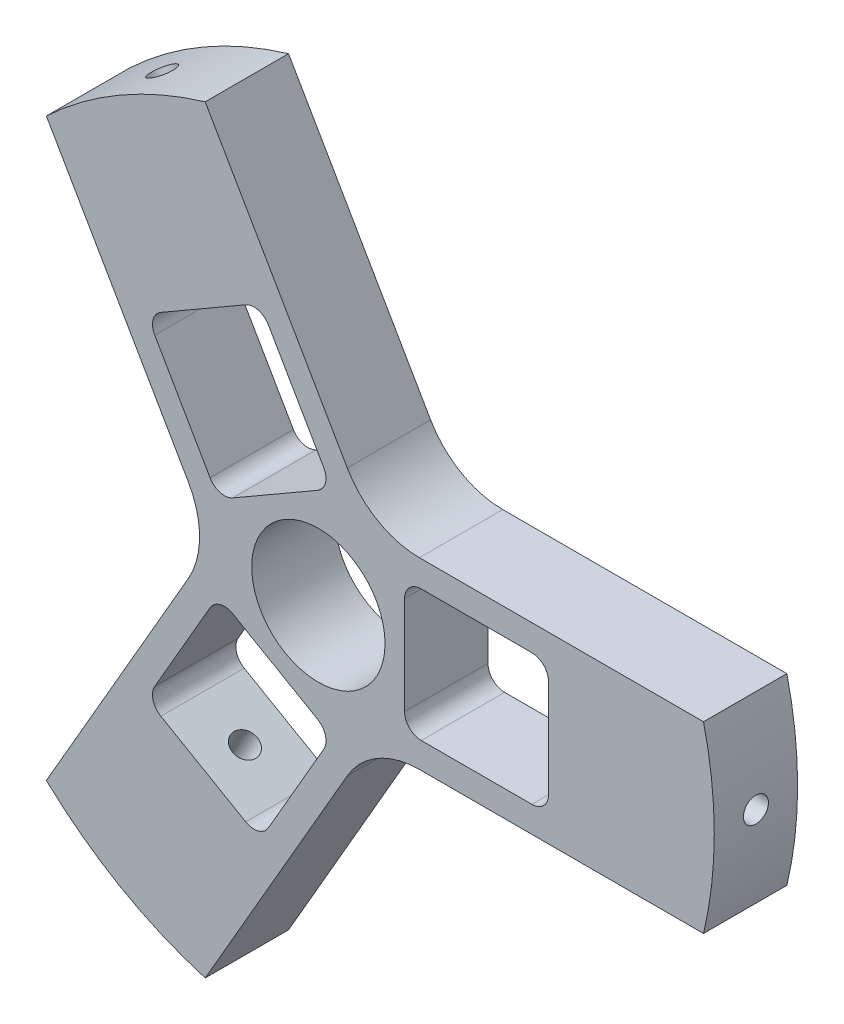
ISO-10303-21;
HEADER;
FILE_DESCRIPTION(('STEP AP214'),'2;1');
FILE_NAME('part.step','',(''),(''),'','','');
FILE_SCHEMA(('AUTOMOTIVE_DESIGN { 1 0 10303 214 1 1 1 1 }'));
ENDSEC;
DATA;
#1=APPLICATION_CONTEXT('core data for automotive mechanical design processes');
#2=APPLICATION_PROTOCOL_DEFINITION('international standard','automotive_design',2000,#1);
#3=PRODUCT_CONTEXT('',#1,'mechanical');
#4=PRODUCT('Part','Part','',(#3));
#5=PRODUCT_RELATED_PRODUCT_CATEGORY('part','',(#4));
#6=PRODUCT_DEFINITION_FORMATION('','',#4);
#7=PRODUCT_DEFINITION_CONTEXT('part definition',#1,'design');
#8=PRODUCT_DEFINITION('design','',#6,#7);
#9=PRODUCT_DEFINITION_SHAPE('','',#8);
#10=(LENGTH_UNIT() NAMED_UNIT(*) SI_UNIT(.MILLI.,.METRE.));
#11=(NAMED_UNIT(*) PLANE_ANGLE_UNIT() SI_UNIT($,.RADIAN.));
#12=(NAMED_UNIT(*) SI_UNIT($,.STERADIAN.) SOLID_ANGLE_UNIT());
#13=UNCERTAINTY_MEASURE_WITH_UNIT(LENGTH_MEASURE(1.E-05),#10,'distance_accuracy_value','');
#14=(GEOMETRIC_REPRESENTATION_CONTEXT(3) GLOBAL_UNCERTAINTY_ASSIGNED_CONTEXT((#13)) GLOBAL_UNIT_ASSIGNED_CONTEXT((#10,
#11,#12)) REPRESENTATION_CONTEXT('',''));
#15=CARTESIAN_POINT('',(0.,0.,0.));
#16=DIRECTION('',(0.,0.,1.));
#17=DIRECTION('',(1.,0.,0.));
#18=AXIS2_PLACEMENT_3D('',#15,#16,#17);
#19=CARTESIAN_POINT('',(0.,0.,10.));
#20=DIRECTION('',(0.,0.,-1.));
#21=DIRECTION('',(-1.,0.,0.));
#22=AXIS2_PLACEMENT_3D('',#19,#20,#21);
#23=CYLINDRICAL_SURFACE('',#22,47.5);
#24=CARTESIAN_POINT('',(0.,0.,0.));
#25=DIRECTION('',(0.,0.,1.));
#26=DIRECTION('',(-0.499999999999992,0.866025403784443,0.));
#27=AXIS2_PLACEMENT_3D('',#24,#25,#26);
#28=CIRCLE('',#27,47.5);
#29=CARTESIAN_POINT('',(-13.5781032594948,45.5179647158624,0.));
#30=VERTEX_POINT('',#29);
#31=CARTESIAN_POINT('',(-32.6306621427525,34.5179647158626,0.));
#32=VERTEX_POINT('',#31);
#33=EDGE_CURVE('E477',#30,#32,#28,.T.);
#34=ORIENTED_EDGE('',*,*,#33,.T.);
#35=DIRECTION('',(0.,0.,-1.));
#36=VECTOR('',#35,1.);
#37=CARTESIAN_POINT('',(-32.6306621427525,34.5179647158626,10.));
#38=LINE('',#37,#36);
#39=CARTESIAN_POINT('',(-32.6306621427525,34.5179647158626,10.));
#40=VERTEX_POINT('',#39);
#41=EDGE_CURVE('E474',#40,#32,#38,.T.);
#42=ORIENTED_EDGE('',*,*,#41,.F.);
#43=CARTESIAN_POINT('',(0.,0.,10.));
#44=DIRECTION('',(0.,0.,1.));
#45=DIRECTION('',(-0.499999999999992,0.866025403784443,0.));
#46=AXIS2_PLACEMENT_3D('',#43,#44,#45);
#47=CIRCLE('',#46,47.5);
#48=CARTESIAN_POINT('',(-13.5781032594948,45.5179647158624,10.));
#49=VERTEX_POINT('',#48);
#50=EDGE_CURVE('E468',#49,#40,#47,.T.);
#51=ORIENTED_EDGE('',*,*,#50,.F.);
#52=DIRECTION('',(0.,0.,-1.));
#53=VECTOR('',#52,1.);
#54=CARTESIAN_POINT('',(-13.5781032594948,45.5179647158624,10.));
#55=LINE('',#54,#53);
#56=EDGE_CURVE('E483',#49,#30,#55,.T.);
#57=ORIENTED_EDGE('',*,*,#56,.T.);
#58=EDGE_LOOP('',(#34,#42,#51,#57));
#59=FACE_BOUND('',#58,.T.);
#60=CARTESIAN_POINT('',(-22.4391168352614,41.8656904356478,5.));
#61=CARTESIAN_POINT('',(-22.4391202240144,41.8656888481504,4.91576688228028));
#62=CARTESIAN_POINT('',(-22.4453953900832,41.8623271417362,4.83147322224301));
#63=CARTESIAN_POINT('',(-22.4703311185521,41.8489475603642,4.66520893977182));
#64=CARTESIAN_POINT('',(-22.4890064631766,41.8389217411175,4.58324121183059));
#65=CARTESIAN_POINT('',(-22.5381813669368,41.8124521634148,4.42406150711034));
#66=CARTESIAN_POINT('',(-22.5686751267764,41.7960115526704,4.34684721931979));
#67=CARTESIAN_POINT('',(-22.6405703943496,41.7571099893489,4.19934927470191));
#68=CARTESIAN_POINT('',(-22.6819692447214,41.7346505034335,4.12906393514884));
#69=CARTESIAN_POINT('',(-22.7744705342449,41.6842447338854,3.99736300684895));
#70=CARTESIAN_POINT('',(-22.8255770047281,41.6562961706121,3.93595112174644));
#71=CARTESIAN_POINT('',(-22.9359786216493,41.5956108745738,3.82377156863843));
#72=CARTESIAN_POINT('',(-22.9952740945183,41.5628739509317,3.77300432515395));
#73=CARTESIAN_POINT('',(-23.1203284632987,41.493439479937,3.68354882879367));
#74=CARTESIAN_POINT('',(-23.1860885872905,41.4567411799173,3.64486287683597));
#75=CARTESIAN_POINT('',(-23.3221502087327,41.3803502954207,3.58068306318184));
#76=CARTESIAN_POINT('',(-23.3924516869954,41.3406577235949,3.55518914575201));
#77=CARTESIAN_POINT('',(-23.5355427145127,41.2593625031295,3.51812526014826));
#78=CARTESIAN_POINT('',(-23.6083314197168,41.21776050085,3.50655061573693));
#79=CARTESIAN_POINT('',(-23.7543361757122,41.1337890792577,3.49763942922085));
#80=CARTESIAN_POINT('',(-23.8275522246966,41.0914196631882,3.50030282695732));
#81=CARTESIAN_POINT('',(-23.9723095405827,41.0071382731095,3.51978817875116));
#82=CARTESIAN_POINT('',(-24.0438513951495,40.9652261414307,3.5366050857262));
#83=CARTESIAN_POINT('',(-24.183279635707,40.8830715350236,3.58391227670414));
#84=CARTESIAN_POINT('',(-24.2511660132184,40.8428290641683,3.61440259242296));
#85=CARTESIAN_POINT('',(-24.3814084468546,40.7652140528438,3.68819687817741));
#86=CARTESIAN_POINT('',(-24.4437635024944,40.7278420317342,3.73150316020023));
#87=CARTESIAN_POINT('',(-24.5612126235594,40.6571216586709,3.82969835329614));
#88=CARTESIAN_POINT('',(-24.6163066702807,40.6237733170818,3.88458729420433));
#89=CARTESIAN_POINT('',(-24.7177512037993,40.5621289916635,4.00441827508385));
#90=CARTESIAN_POINT('',(-24.7640978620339,40.5338352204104,4.0693646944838));
#91=CARTESIAN_POINT('',(-24.8467588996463,40.4832178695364,4.20745159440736));
#92=CARTESIAN_POINT('',(-24.8830732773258,40.4608942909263,4.28059207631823));
#93=CARTESIAN_POINT('',(-24.9446881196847,40.4229371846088,4.432993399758));
#94=CARTESIAN_POINT('',(-24.9699884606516,40.4073037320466,4.51225431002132));
#95=CARTESIAN_POINT('',(-25.0088921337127,40.3832371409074,4.67464542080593));
#96=CARTESIAN_POINT('',(-25.0224955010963,40.3748039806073,4.75777560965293));
#97=CARTESIAN_POINT('',(-25.0376356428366,40.3654169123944,4.92550703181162));
#98=CARTESIAN_POINT('',(-25.0391776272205,40.3644597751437,5.01010761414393));
#99=CARTESIAN_POINT('',(-25.0301672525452,40.3700477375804,5.17841210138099));
#100=CARTESIAN_POINT('',(-25.0196149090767,40.3765928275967,5.26211600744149));
#101=CARTESIAN_POINT('',(-24.9867031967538,40.3969681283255,5.42623398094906));
#102=CARTESIAN_POINT('',(-24.9643461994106,40.4107968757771,5.50664870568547));
#103=CARTESIAN_POINT('',(-24.9084285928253,40.4452872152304,5.66192581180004));
#104=CARTESIAN_POINT('',(-24.8748679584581,40.4659488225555,5.73678818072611));
#105=CARTESIAN_POINT('',(-24.7974353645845,40.5134453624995,5.87886371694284));
#106=CARTESIAN_POINT('',(-24.7535598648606,40.540282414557,5.94607424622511));
#107=CARTESIAN_POINT('',(-24.6566931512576,40.599269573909,6.07091173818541));
#108=CARTESIAN_POINT('',(-24.60370191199,40.6314196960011,6.12853867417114));
#109=CARTESIAN_POINT('',(-24.4900286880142,40.7000355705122,6.23259360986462));
#110=CARTESIAN_POINT('',(-24.429344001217,40.736502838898,6.27901765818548));
#111=CARTESIAN_POINT('',(-24.3019676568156,40.8126189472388,6.35932198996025));
#112=CARTESIAN_POINT('',(-24.2352760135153,40.8522677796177,6.39320230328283));
#113=CARTESIAN_POINT('',(-24.0977498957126,40.9335415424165,6.44745049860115));
#114=CARTESIAN_POINT('',(-24.0269162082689,40.9751660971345,6.46782093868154));
#115=CARTESIAN_POINT('',(-23.8830795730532,41.0591700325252,6.49447953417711));
#116=CARTESIAN_POINT('',(-23.8100766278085,41.1015494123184,6.50076770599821));
#117=CARTESIAN_POINT('',(-23.663999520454,41.1858256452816,6.49908297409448));
#118=CARTESIAN_POINT('',(-23.5909254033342,41.2277227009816,6.4911162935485));
#119=CARTESIAN_POINT('',(-23.4467591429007,41.3098822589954,6.46116080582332));
#120=CARTESIAN_POINT('',(-23.3756670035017,41.3501447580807,6.43917197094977));
#121=CARTESIAN_POINT('',(-23.2375093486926,41.4279428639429,6.381797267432));
#122=CARTESIAN_POINT('',(-23.1704438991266,41.4654784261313,6.34641117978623));
#123=CARTESIAN_POINT('',(-23.0422874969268,41.536831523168,6.26324844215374));
#124=CARTESIAN_POINT('',(-22.9811963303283,41.5706491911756,6.21547223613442));
#125=CARTESIAN_POINT('',(-22.8667503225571,41.6337123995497,6.10886655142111));
#126=CARTESIAN_POINT('',(-22.8133980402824,41.66295642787,6.05003343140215));
#127=CARTESIAN_POINT('',(-22.7160107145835,41.7161353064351,5.92297337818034));
#128=CARTESIAN_POINT('',(-22.6719779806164,41.7400688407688,5.85474412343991));
#129=CARTESIAN_POINT('',(-22.5945256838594,41.7820458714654,5.71080024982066));
#130=CARTESIAN_POINT('',(-22.5611132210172,41.8000854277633,5.63508066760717));
#131=CARTESIAN_POINT('',(-22.505967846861,41.8298027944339,5.4783987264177));
#132=CARTESIAN_POINT('',(-22.4842210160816,41.841488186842,5.39744274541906));
#133=CARTESIAN_POINT('',(-22.4588164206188,41.855127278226,5.2633132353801));
#134=CARTESIAN_POINT('',(-22.4514387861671,41.8590841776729,5.21101020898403));
#135=CARTESIAN_POINT('',(-22.4415879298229,41.8643662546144,5.10581275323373));
#136=CARTESIAN_POINT('',(-22.4391147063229,41.8656914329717,5.05291832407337));
#137=CARTESIAN_POINT('',(-22.4391168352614,41.8656904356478,5.));
#138=B_SPLINE_CURVE_WITH_KNOTS('',3,(#60,#61,#62,#63,#64,#65,#66,#67,#68,#69,#70,#71,#72,#73,
#74,#75,#76,#77,#78,#79,#80,#81,#82,#83,#84,#85,#86,#87,#88,#89,#90,#91,#92,#93,#94,#95,#96,#97,
#98,#99,#100,#101,#102,#103,#104,#105,#106,#107,#108,#109,#110,#111,#112,#113,#114,#115,#116,
#117,#118,#119,#120,#121,#122,#123,#124,#125,#126,#127,#128,#129,#130,#131,#132,#133,#134,#135,
#136,#137),.UNSPECIFIED.,.T.,.F.,(4,2,2,2,2,2,2,2,2,2,2,2,2,2,2,2,2,2,2,2,2,2,2,2,2,2,2,2,2,2,2,
2,2,2,2,2,2,2,4),(0.,0.252506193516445,0.505313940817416,0.75799779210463,1.01062012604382,
1.2633475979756,1.5160851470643,1.76887080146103,2.02165538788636,2.27435502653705,
2.52705359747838,2.7796620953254,3.03227117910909,3.28492586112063,3.53758119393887,
3.79034685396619,4.04311255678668,4.29588109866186,4.54864887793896,4.80130746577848,
5.05396572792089,5.30657325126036,5.55918134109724,5.81187625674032,6.06457187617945,
6.31735649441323,6.57014051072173,6.82287664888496,7.07561249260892,7.32823802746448,
7.58086406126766,7.83349422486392,8.08611533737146,8.33881979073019,8.59158679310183,
8.844522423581,9.09715557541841,9.25578924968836,9.4144228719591),.UNSPECIFIED.);
#139=CARTESIAN_POINT('',(-22.4391168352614,41.8656904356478,5.));
#140=VERTEX_POINT('',#139);
#141=EDGE_CURVE('E567',#140,#140,#138,.T.);
#142=ORIENTED_EDGE('',*,*,#141,.F.);
#143=EDGE_LOOP('',(#142));
#144=FACE_BOUND('',#143,.T.);
#145=ADVANCED_FACE('F33',(#59,#144),#23,.T.);
#146=CARTESIAN_POINT('',(0.,0.,10.));
#147=DIRECTION('',(0.,0.,-1.));
#148=DIRECTION('',(-1.,0.,0.));
#149=AXIS2_PLACEMENT_3D('',#146,#147,#148);
#150=CYLINDRICAL_SURFACE('',#149,47.5);
#151=CARTESIAN_POINT('',(0.,0.,0.));
#152=DIRECTION('',(0.,0.,1.));
#153=DIRECTION('',(-0.500000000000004,-0.866025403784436,0.));
#154=AXIS2_PLACEMENT_3D('',#151,#152,#153);
#155=CIRCLE('',#154,47.5);
#156=CARTESIAN_POINT('',(-32.630662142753,-34.5179647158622,0.));
#157=VERTEX_POINT('',#156);
#158=CARTESIAN_POINT('',(-13.5781032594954,-45.5179647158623,0.));
#159=VERTEX_POINT('',#158);
#160=EDGE_CURVE('E497',#157,#159,#155,.T.);
#161=ORIENTED_EDGE('',*,*,#160,.T.);
#162=DIRECTION('',(0.,0.,-1.));
#163=VECTOR('',#162,1.);
#164=CARTESIAN_POINT('',(-13.5781032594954,-45.5179647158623,10.));
#165=LINE('',#164,#163);
#166=CARTESIAN_POINT('',(-13.5781032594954,-45.5179647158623,10.));
#167=VERTEX_POINT('',#166);
#168=EDGE_CURVE('E495',#167,#159,#165,.T.);
#169=ORIENTED_EDGE('',*,*,#168,.F.);
#170=CARTESIAN_POINT('',(0.,0.,10.));
#171=DIRECTION('',(0.,0.,1.));
#172=DIRECTION('',(-0.500000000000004,-0.866025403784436,0.));
#173=AXIS2_PLACEMENT_3D('',#170,#171,#172);
#174=CIRCLE('',#173,47.5);
#175=CARTESIAN_POINT('',(-32.630662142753,-34.5179647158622,10.));
#176=VERTEX_POINT('',#175);
#177=EDGE_CURVE('E489',#176,#167,#174,.T.);
#178=ORIENTED_EDGE('',*,*,#177,.F.);
#179=DIRECTION('',(0.,0.,-1.));
#180=VECTOR('',#179,1.);
#181=CARTESIAN_POINT('',(-32.630662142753,-34.5179647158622,10.));
#182=LINE('',#181,#180);
#183=EDGE_CURVE('E503',#176,#157,#182,.T.);
#184=ORIENTED_EDGE('',*,*,#183,.T.);
#185=EDGE_LOOP('',(#161,#169,#178,#184));
#186=FACE_BOUND('',#185,.T.);
#187=CARTESIAN_POINT('',(-25.0371930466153,-40.3656904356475,5.));
#188=CARTESIAN_POINT('',(-25.0371899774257,-40.3656925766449,4.91576688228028));
#189=CARTESIAN_POINT('',(-25.0311410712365,-40.3694461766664,4.83147322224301));
#190=CARTESIAN_POINT('',(-25.007086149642,-40.3843513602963,4.66520893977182));
#191=CARTESIAN_POINT('',(-24.9890658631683,-40.3955117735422,4.58324121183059));
#192=CARTESIAN_POINT('',(-24.9415550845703,-40.4248637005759,4.42406150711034));
#193=CARTESIAN_POINT('',(-24.912070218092,-40.4430517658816,4.34684721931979));
#194=CARTESIAN_POINT('',(-24.8424328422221,-40.4858641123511,4.19934927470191));
#195=CARTESIAN_POINT('',(-24.8022829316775,-40.5104868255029,4.12906393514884));
#196=CARTESIAN_POINT('',(-24.7123796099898,-40.5653924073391,3.99736300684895));
#197=CARTESIAN_POINT('',(-24.6626222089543,-40.5956776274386,3.93595112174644));
#198=CARTESIAN_POINT('',(-24.5548663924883,-40.6609455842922,3.82377156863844));
#199=CARTESIAN_POINT('',(-24.496867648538,-40.695928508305,3.77300432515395));
#200=CARTESIAN_POINT('',(-24.3742084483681,-40.7695115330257,3.68354882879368));
#201=CARTESIAN_POINT('',(-24.3095467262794,-40.8081123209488,3.64486287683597));
#202=CARTESIAN_POINT('',(-24.1753594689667,-40.8877496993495,3.58068306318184));
#203=CARTESIAN_POINT('',(-24.1058339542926,-40.9287862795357,3.55518914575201));
#204=CARTESIAN_POINT('',(-23.9638847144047,-41.0120591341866,3.51812526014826));
#205=CARTESIAN_POINT('',(-23.8914619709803,-41.0542950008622,3.50655061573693));
#206=CARTESIAN_POINT('',(-23.7457382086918,-41.1387531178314,3.49763942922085));
#207=CARTESIAN_POINT('',(-23.6724371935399,-41.1809753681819,3.50030282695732));
#208=CARTESIAN_POINT('',(-23.5270687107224,-41.2641981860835,3.51978817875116));
#209=CARTESIAN_POINT('',(-23.4550008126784,-41.3051991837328,3.5366050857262));
#210=CARTESIAN_POINT('',(-23.3141387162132,-41.3848702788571,3.58391227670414));
#211=CARTESIAN_POINT('',(-23.2453445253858,-41.4235403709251,3.61440259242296));
#212=CARTESIAN_POINT('',(-23.1130067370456,-41.4975261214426,3.6881968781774));
#213=CARTESIAN_POINT('',(-23.0494640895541,-41.5328411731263,3.73150316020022));
#214=CARTESIAN_POINT('',(-22.9294938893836,-41.599194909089,3.82969835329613));
#215=CARTESIAN_POINT('',(-22.8730663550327,-41.6302335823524,3.88458729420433));
#216=CARTESIAN_POINT('',(-22.768958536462,-41.6872649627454,4.00441827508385));
#217=CARTESIAN_POINT('',(-22.7212820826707,-41.7132554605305,4.0693646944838));
#218=CARTESIAN_POINT('',(-22.6361156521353,-41.7595333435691,4.20745159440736));
#219=CARTESIAN_POINT('',(-22.5986256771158,-41.7798207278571,4.28059207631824));
#220=CARTESIAN_POINT('',(-22.5349464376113,-41.8142021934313,4.43299339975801));
#221=CARTESIAN_POINT('',(-22.5087573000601,-41.828296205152,4.51225431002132));
#222=CARTESIAN_POINT('',(-22.4684631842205,-41.8499544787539,4.67464542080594));
#223=CARTESIAN_POINT('',(-22.4543581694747,-41.857518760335,4.75777560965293));
#224=CARTESIAN_POINT('',(-22.4386586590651,-41.8659369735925,4.92550703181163));
#225=CARTESIAN_POINT('',(-22.4370587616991,-41.8667938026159,5.01010761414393));
#226=CARTESIAN_POINT('',(-22.4464032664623,-41.8617845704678,5.17841210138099));
#227=CARTESIAN_POINT('',(-22.4573476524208,-41.8559185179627,5.26211600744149));
#228=CARTESIAN_POINT('',(-22.4914490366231,-41.8376037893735,5.42623398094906));
#229=CARTESIAN_POINT('',(-22.5146035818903,-41.8251564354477,5.50664870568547));
#230=CARTESIAN_POINT('',(-22.5724318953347,-41.7939755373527,5.66192581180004));
#231=CARTESIAN_POINT('',(-22.6071056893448,-41.7752419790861,5.73678818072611));
#232=CARTESIAN_POINT('',(-22.686955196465,-41.7319316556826,5.87886371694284));
#233=CARTESIAN_POINT('',(-22.7321345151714,-41.7073528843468,5.94607424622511));
#234=CARTESIAN_POINT('',(-22.8316522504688,-41.6529574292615,6.07091173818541));
#235=CARTESIAN_POINT('',(-22.8859906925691,-41.6231407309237,6.12853867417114));
#236=CARTESIAN_POINT('',(-23.0022503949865,-41.5590047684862,6.23259360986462));
#237=CARTESIAN_POINT('',(-23.0641743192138,-41.524683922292,6.27901765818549));
#238=CARTESIAN_POINT('',(-23.1937809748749,-41.4524308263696,6.35932198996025));
#239=CARTESIAN_POINT('',(-23.2614636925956,-41.4144985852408,6.39320230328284));
#240=CARTESIAN_POINT('',(-23.4006118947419,-41.3360343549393,6.44745049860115));
#241=CARTESIAN_POINT('',(-23.4720766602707,-41.2955028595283,6.46782093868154));
#242=CARTESIAN_POINT('',(-23.6167445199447,-41.212938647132,6.49447953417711));
#243=CARTESIAN_POINT('',(-23.6899476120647,-41.1709059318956,6.50076770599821));
#244=CARTESIAN_POINT('',(-23.8359715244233,-41.0865375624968,6.49908297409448));
#245=CARTESIAN_POINT('',(-23.9087924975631,-41.044202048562,6.4911162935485));
#246=CARTESIAN_POINT('',(-24.0520278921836,-40.9604301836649,6.46116080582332));
#247=CARTESIAN_POINT('',(-24.1224423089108,-40.9189938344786,6.43917197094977));
#248=CARTESIAN_POINT('',(-24.2588962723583,-40.8382448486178,6.381797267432));
#249=CARTESIAN_POINT('',(-24.3249357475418,-40.7989322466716,6.34641117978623));
#250=CARTESIAN_POINT('',(-24.4508075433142,-40.7236220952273,6.26324844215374));
#251=CARTESIAN_POINT('',(-24.5106400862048,-40.6876244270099,6.21547223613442));
#252=CARTESIAN_POINT('',(-24.6224774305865,-40.6200428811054,6.10886655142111));
#253=CARTESIAN_POINT('',(-24.6744796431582,-40.5884604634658,6.05003343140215));
#254=CARTESIAN_POINT('',(-24.7692275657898,-40.5307100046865,5.92297337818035));
#255=CARTESIAN_POINT('',(-24.8119709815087,-40.5045433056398,5.85474412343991));
#256=CARTESIAN_POINT('',(-24.8870503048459,-40.458456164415,5.71080024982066));
#257=CARTESIAN_POINT('',(-24.9193792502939,-40.4385399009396,5.63508066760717));
#258=CARTESIAN_POINT('',(-24.9726879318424,-40.4056412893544,5.4783987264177));
#259=CARTESIAN_POINT('',(-24.9936811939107,-40.3926506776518,5.39744274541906));
#260=CARTESIAN_POINT('',(-25.0181952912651,-40.3774691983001,5.26331323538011));
#261=CARTESIAN_POINT('',(-25.0253108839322,-40.3730584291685,5.21101020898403));
#262=CARTESIAN_POINT('',(-25.0348107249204,-40.3671683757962,5.10581275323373));
#263=CARTESIAN_POINT('',(-25.0371949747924,-40.3656890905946,5.05291832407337));
#264=CARTESIAN_POINT('',(-25.0371930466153,-40.3656904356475,5.));
#265=B_SPLINE_CURVE_WITH_KNOTS('',3,(#187,#188,#189,#190,#191,#192,#193,#194,#195,#196,#197,
#198,#199,#200,#201,#202,#203,#204,#205,#206,#207,#208,#209,#210,#211,#212,#213,#214,#215,#216,
#217,#218,#219,#220,#221,#222,#223,#224,#225,#226,#227,#228,#229,#230,#231,#232,#233,#234,#235,
#236,#237,#238,#239,#240,#241,#242,#243,#244,#245,#246,#247,#248,#249,#250,#251,#252,#253,#254,
#255,#256,#257,#258,#259,#260,#261,#262,#263,#264),.UNSPECIFIED.,.T.,.F.,(4,2,2,2,2,2,2,2,2,2,2,
2,2,2,2,2,2,2,2,2,2,2,2,2,2,2,2,2,2,2,2,2,2,2,2,2,2,2,4),(0.,0.252506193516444,
0.505313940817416,0.757997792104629,1.01062012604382,1.26334759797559,1.51608514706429,
1.76887080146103,2.02165538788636,2.27435502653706,2.52705359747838,2.7796620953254,
3.03227117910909,3.28492586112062,3.53758119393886,3.79034685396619,4.04311255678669,
4.29588109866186,4.54864887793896,4.80130746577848,5.05396572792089,5.30657325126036,
5.55918134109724,5.81187625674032,6.06457187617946,6.31735649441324,6.57014051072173,
6.82287664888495,7.07561249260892,7.32823802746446,7.58086406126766,7.83349422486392,
8.08611533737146,8.33881979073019,8.59158679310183,8.844522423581,9.09715557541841,
9.25578924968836,9.4144228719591),.UNSPECIFIED.);
#266=CARTESIAN_POINT('',(-25.0371930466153,-40.3656904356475,5.));
#267=VERTEX_POINT('',#266);
#268=EDGE_CURVE('E429',#267,#267,#265,.T.);
#269=ORIENTED_EDGE('',*,*,#268,.F.);
#270=EDGE_LOOP('',(#269));
#271=FACE_BOUND('',#270,.T.);
#272=ADVANCED_FACE('F562',(#186,#271),#150,.T.);
#273=CARTESIAN_POINT('',(0.,0.,10.));
#274=DIRECTION('',(0.,0.,-1.));
#275=DIRECTION('',(-1.,0.,0.));
#276=AXIS2_PLACEMENT_3D('',#273,#274,#275);
#277=CYLINDRICAL_SURFACE('',#276,47.5);
#278=CARTESIAN_POINT('',(0.,0.,0.));
#279=DIRECTION('',(0.,0.,1.));
#280=DIRECTION('',(1.,0.,0.));
#281=AXIS2_PLACEMENT_3D('',#278,#279,#280);
#282=CIRCLE('',#281,47.5);
#283=CARTESIAN_POINT('',(46.2087654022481,-11.,0.));
#284=VERTEX_POINT('',#283);
#285=CARTESIAN_POINT('',(46.2087654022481,11.,0.));
#286=VERTEX_POINT('',#285);
#287=EDGE_CURVE('E523',#284,#286,#282,.T.);
#288=ORIENTED_EDGE('',*,*,#287,.T.);
#289=DIRECTION('',(0.,0.,-1.));
#290=VECTOR('',#289,1.);
#291=CARTESIAN_POINT('',(46.2087654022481,11.,10.));
#292=LINE('',#291,#290);
#293=CARTESIAN_POINT('',(46.2087654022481,11.,10.));
#294=VERTEX_POINT('',#293);
#295=EDGE_CURVE('E521',#294,#286,#292,.T.);
#296=ORIENTED_EDGE('',*,*,#295,.F.);
#297=CARTESIAN_POINT('',(0.,0.,10.));
#298=DIRECTION('',(0.,0.,1.));
#299=DIRECTION('',(1.,0.,0.));
#300=AXIS2_PLACEMENT_3D('',#297,#298,#299);
#301=CIRCLE('',#300,47.5);
#302=CARTESIAN_POINT('',(46.2087654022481,-11.,10.));
#303=VERTEX_POINT('',#302);
#304=EDGE_CURVE('E515',#303,#294,#301,.T.);
#305=ORIENTED_EDGE('',*,*,#304,.F.);
#306=DIRECTION('',(0.,0.,-1.));
#307=VECTOR('',#306,1.);
#308=CARTESIAN_POINT('',(46.2087654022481,-11.,10.));
#309=LINE('',#308,#307);
#310=EDGE_CURVE('E529',#303,#284,#309,.T.);
#311=ORIENTED_EDGE('',*,*,#310,.T.);
#312=EDGE_LOOP('',(#288,#296,#305,#311));
#313=FACE_BOUND('',#312,.T.);
#314=CARTESIAN_POINT('',(47.5,0.,6.5));
#315=CARTESIAN_POINT('',(47.4999996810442,-0.0842331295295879,6.49999627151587));
#316=CARTESIAN_POINT('',(47.499773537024,-0.16852680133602,6.49288096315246));
#317=CARTESIAN_POINT('',(47.4988931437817,-0.334791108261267,6.46459618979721));
#318=CARTESIAN_POINT('',(47.4982383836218,-0.416758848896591,6.44340995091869));
#319=CARTESIAN_POINT('',(47.4965749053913,-0.575938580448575,6.38758842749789));
#320=CARTESIAN_POINT('',(47.4955663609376,-0.653152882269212,6.35295973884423));
#321=CARTESIAN_POINT('',(47.4933090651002,-0.800650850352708,6.2712457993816));
#322=CARTESIAN_POINT('',(47.4920603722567,-0.870936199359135,6.22416358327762));
#323=CARTESIAN_POINT('',(47.4894626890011,-1.00263711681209,6.11885221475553));
#324=CARTESIAN_POINT('',(47.4881136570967,-1.06404898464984,6.06061843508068));
#325=CARTESIAN_POINT('',(47.4854677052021,-1.17622850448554,5.93466519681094));
#326=CARTESIAN_POINT('',(47.4841707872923,-1.22699573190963,5.86694536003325));
#327=CARTESIAN_POINT('',(47.4817750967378,-1.31645121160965,5.72392787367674));
#328=CARTESIAN_POINT('',(47.4806763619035,-1.35513715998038,5.64862878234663));
#329=CARTESIAN_POINT('',(47.4788013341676,-1.41931696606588,5.49260051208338));
#330=CARTESIAN_POINT('',(47.4780250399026,-1.44481087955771,5.41187135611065));
#331=CARTESIAN_POINT('',(47.4768827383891,-1.48187475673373,5.24730326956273));
#332=CARTESIAN_POINT('',(47.4765165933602,-1.49344939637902,5.16346539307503));
#333=CARTESIAN_POINT('',(47.4762354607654,-1.50236057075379,4.99503583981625));
#334=CARTESIAN_POINT('',(47.4763204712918,-1.49969716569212,4.91044416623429));
#335=CARTESIAN_POINT('',(47.4769319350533,-1.48021180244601,4.74293999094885));
#336=CARTESIAN_POINT('',(47.4774582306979,-1.46339489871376,4.66002690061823));
#337=CARTESIAN_POINT('',(47.4788926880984,-1.4160877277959,4.49820127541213));
#338=CARTESIAN_POINT('',(47.4798008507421,-1.38559742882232,4.41928874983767));
#339=CARTESIAN_POINT('',(47.4818968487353,-1.31180317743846,4.26768803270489));
#340=CARTESIAN_POINT('',(47.4830847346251,-1.26849690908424,4.19500096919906));
#341=CARTESIAN_POINT('',(47.4856062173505,-1.17030174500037,4.05792687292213));
#342=CARTESIAN_POINT('',(47.4869398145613,-1.11541281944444,3.99353986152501));
#343=CARTESIAN_POINT('',(47.4896030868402,-0.995581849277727,3.87486413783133));
#344=CARTESIAN_POINT('',(47.4909327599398,-0.930635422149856,3.82057985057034));
#345=CARTESIAN_POINT('',(47.4934377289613,-0.792548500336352,3.72368458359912));
#346=CARTESIAN_POINT('',(47.4946130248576,-0.719408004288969,3.68107360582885));
#347=CARTESIAN_POINT('',(47.496676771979,-0.56700667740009,3.60873502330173));
#348=CARTESIAN_POINT('',(47.497565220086,-0.487745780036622,3.57900755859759));
#349=CARTESIAN_POINT('',(47.4989550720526,-0.325354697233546,3.53328268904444));
#350=CARTESIAN_POINT('',(47.4994564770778,-0.24222452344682,3.51728524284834));
#351=CARTESIAN_POINT('',(47.5000155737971,-0.0744931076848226,3.49947994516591));
#352=CARTESIAN_POINT('',(47.5000734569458,0.0101074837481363,3.4976659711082));
#353=CARTESIAN_POINT('',(47.4997394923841,0.178411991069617,3.50826315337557));
#354=CARTESIAN_POINT('',(47.4993476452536,0.262115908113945,3.52067429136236));
#355=CARTESIAN_POINT('',(47.4981585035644,0.426233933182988,3.55936432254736));
#356=CARTESIAN_POINT('',(47.4973612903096,0.506648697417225,3.5856404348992));
#357=CARTESIAN_POINT('',(47.4954512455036,0.661925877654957,3.65131170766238));
#358=CARTESIAN_POINT('',(47.494338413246,0.736788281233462,3.69070689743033));
#359=CARTESIAN_POINT('',(47.4919220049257,0.878863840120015,3.78151379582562));
#360=CARTESIAN_POINT('',(47.4906183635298,0.946074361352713,3.83292962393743));
#361=CARTESIAN_POINT('',(47.4879674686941,1.0709118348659,3.94631224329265));
#362=CARTESIAN_POINT('',(47.4866202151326,1.12853876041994,4.00827906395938));
#363=CARTESIAN_POINT('',(47.4840334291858,1.23259367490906,4.14103089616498));
#364=CARTESIAN_POINT('',(47.4827939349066,1.27901771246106,4.21181900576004));
#365=CARTESIAN_POINT('',(47.480563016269,1.35932202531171,4.36018819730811));
#366=CARTESIAN_POINT('',(47.4795715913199,1.39320233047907,4.43776926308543));
#367=CARTESIAN_POINT('',(47.4779488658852,1.44745052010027,4.59750726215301));
#368=CARTESIAN_POINT('',(47.4773174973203,1.46782095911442,4.67966332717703));
#369=CARTESIAN_POINT('',(47.4764858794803,1.49447954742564,4.84623150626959));
#370=CARTESIAN_POINT('',(47.4762856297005,1.50076771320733,4.93064361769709));
#371=CARTESIAN_POINT('',(47.4763388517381,1.49908296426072,5.09928820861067));
#372=CARTESIAN_POINT('',(47.4765921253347,1.49111627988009,5.18352075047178));
#373=CARTESIAN_POINT('',(47.4775234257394,1.46116079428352,5.34945211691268));
#374=CARTESIAN_POINT('',(47.4782014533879,1.43917196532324,5.43115093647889));
#375=CARTESIAN_POINT('',(47.4799057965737,1.38179728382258,5.58969797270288));
#376=CARTESIAN_POINT('',(47.4809321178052,1.34641121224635,5.66654611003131));
#377=CARTESIAN_POINT('',(47.4832173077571,1.26324851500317,5.81320931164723));
#378=CARTESIAN_POINT('',(47.4844761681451,1.21547233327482,5.88302462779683));
#379=CARTESIAN_POINT('',(47.4870850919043,1.10886667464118,6.01366938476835));
#380=CARTESIAN_POINT('',(47.4884351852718,1.05003355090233,6.07449584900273));
#381=CARTESIAN_POINT('',(47.4910744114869,0.922973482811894,6.18542522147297));
#382=CARTESIAN_POINT('',(47.4923635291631,0.854744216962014,6.23552547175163));
#383=CARTESIAN_POINT('',(47.494735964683,0.710800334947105,6.32358966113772));
#384=CARTESIAN_POINT('',(47.495819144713,0.63508075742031,6.36154548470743));
#385=CARTESIAN_POINT('',(47.4976551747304,0.478398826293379,6.4241614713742));
#386=CARTESIAN_POINT('',(47.4984084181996,0.397442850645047,6.44883748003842));
#387=CARTESIAN_POINT('',(47.4992985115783,0.263313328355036,6.47765806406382));
#388=CARTESIAN_POINT('',(47.4995604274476,0.211010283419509,6.48602573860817));
#389=CARTESIAN_POINT('',(47.49991127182,0.105812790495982,6.49719787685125));
#390=CARTESIAN_POINT('',(47.5000002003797,0.0529183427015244,6.50000234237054));
#391=CARTESIAN_POINT('',(47.5,0.,6.5));
#392=B_SPLINE_CURVE_WITH_KNOTS('',3,(#314,#315,#316,#317,#318,#319,#320,#321,#322,#323,#324,
#325,#326,#327,#328,#329,#330,#331,#332,#333,#334,#335,#336,#337,#338,#339,#340,#341,#342,#343,
#344,#345,#346,#347,#348,#349,#350,#351,#352,#353,#354,#355,#356,#357,#358,#359,#360,#361,#362,
#363,#364,#365,#366,#367,#368,#369,#370,#371,#372,#373,#374,#375,#376,#377,#378,#379,#380,#381,
#382,#383,#384,#385,#386,#387,#388,#389,#390,#391),.UNSPECIFIED.,.T.,.F.,(4,2,2,2,2,2,2,2,2,2,2,
2,2,2,2,2,2,2,2,2,2,2,2,2,2,2,2,2,2,2,2,2,2,2,2,2,2,2,4),(0.,0.252506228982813,
0.505314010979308,0.757997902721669,1.01062027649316,1.26334770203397,1.51608520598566,
1.76887087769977,2.02165548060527,2.27435514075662,2.52705373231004,2.77966211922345,
3.03227109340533,3.28492574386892,3.53758104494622,3.79034675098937,4.04311249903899,
4.29588099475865,4.548648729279,4.80130734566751,5.05396563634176,5.30657327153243,
5.55918147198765,5.81187636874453,6.06457197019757,6.31735657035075,6.5701405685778,
6.82287675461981,7.07561264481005,7.3282380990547,7.58086405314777,7.83349413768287,
8.08611517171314,8.33881967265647,8.59158672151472,8.84452233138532,9.09715546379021,
9.25578919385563,9.41442287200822),.UNSPECIFIED.);
#393=CARTESIAN_POINT('',(47.5,0.,6.5));
#394=VERTEX_POINT('',#393);
#395=EDGE_CURVE('E532',#394,#394,#392,.T.);
#396=ORIENTED_EDGE('',*,*,#395,.F.);
#397=EDGE_LOOP('',(#396));
#398=FACE_BOUND('',#397,.T.);
#399=ADVANCED_FACE('F541',(#313,#398),#277,.T.);
#400=CARTESIAN_POINT('',(0.,-11.,10.));
#401=DIRECTION('',(0.,1.,0.));
#402=DIRECTION('',(0.,0.,1.));
#403=AXIS2_PLACEMENT_3D('',#400,#401,#402);
#404=PLANE('',#403);
#405=DIRECTION('',(1.,0.,0.));
#406=VECTOR('',#405,1.);
#407=CARTESIAN_POINT('',(0.,-11.,10.));
#408=LINE('',#407,#406);
#409=CARTESIAN_POINT('',(12.1243556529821,-11.,10.));
#410=VERTEX_POINT('',#409);
#411=EDGE_CURVE('E513',#410,#303,#408,.T.);
#412=ORIENTED_EDGE('',*,*,#411,.F.);
#413=DIRECTION('',(0.,0.,1.));
#414=VECTOR('',#413,1.);
#415=CARTESIAN_POINT('',(12.1243556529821,-11.,0.));
#416=LINE('',#415,#414);
#417=CARTESIAN_POINT('',(12.1243556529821,-11.,0.));
#418=VERTEX_POINT('',#417);
#419=EDGE_CURVE('E654',#410,#418,#416,.F.);
#420=ORIENTED_EDGE('',*,*,#419,.T.);
#421=DIRECTION('',(1.,0.,0.));
#422=VECTOR('',#421,1.);
#423=CARTESIAN_POINT('',(0.,-11.,0.));
#424=LINE('',#423,#422);
#425=EDGE_CURVE('E510',#418,#284,#424,.T.);
#426=ORIENTED_EDGE('',*,*,#425,.T.);
#427=ORIENTED_EDGE('',*,*,#310,.F.);
#428=EDGE_LOOP('',(#412,#420,#426,#427));
#429=FACE_BOUND('',#428,.T.);
#430=ADVANCED_FACE('F692',(#429),#404,.F.);
#431=CARTESIAN_POINT('',(0.,11.,10.));
#432=DIRECTION('',(0.,-1.,0.));
#433=DIRECTION('',(0.,0.,-1.));
#434=AXIS2_PLACEMENT_3D('',#431,#432,#433);
#435=PLANE('',#434);
#436=DIRECTION('',(-1.,0.,0.));
#437=VECTOR('',#436,1.);
#438=CARTESIAN_POINT('',(0.,11.,0.));
#439=LINE('',#438,#437);
#440=CARTESIAN_POINT('',(12.1243556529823,11.,0.));
#441=VERTEX_POINT('',#440);
#442=EDGE_CURVE('E516',#286,#441,#439,.T.);
#443=ORIENTED_EDGE('',*,*,#442,.T.);
#444=DIRECTION('',(0.,0.,-1.));
#445=VECTOR('',#444,1.);
#446=CARTESIAN_POINT('',(12.1243556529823,11.,10.));
#447=LINE('',#446,#445);
#448=CARTESIAN_POINT('',(12.1243556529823,11.,10.));
#449=VERTEX_POINT('',#448);
#450=EDGE_CURVE('E718',#441,#449,#447,.F.);
#451=ORIENTED_EDGE('',*,*,#450,.T.);
#452=DIRECTION('',(-1.,0.,0.));
#453=VECTOR('',#452,1.);
#454=CARTESIAN_POINT('',(0.,11.,10.));
#455=LINE('',#454,#453);
#456=EDGE_CURVE('E518',#294,#449,#455,.T.);
#457=ORIENTED_EDGE('',*,*,#456,.F.);
#458=ORIENTED_EDGE('',*,*,#295,.T.);
#459=EDGE_LOOP('',(#443,#451,#457,#458));
#460=FACE_BOUND('',#459,.T.);
#461=ADVANCED_FACE('F698',(#460),#435,.F.);
#462=CARTESIAN_POINT('',(0.,0.,10.));
#463=DIRECTION('',(0.,0.,1.));
#464=DIRECTION('',(1.,0.,0.));
#465=AXIS2_PLACEMENT_3D('',#462,#463,#464);
#466=PLANE('',#465);
#467=CARTESIAN_POINT('',(-1.08381407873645,13.6304864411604,10.));
#468=DIRECTION('',(0.,0.,1.));
#469=DIRECTION('',(-0.499999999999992,0.866025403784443,0.));
#470=AXIS2_PLACEMENT_3D('',#467,#468,#469);
#471=CIRCLE('',#470,2.);
#472=CARTESIAN_POINT('',(-0.0838140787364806,11.8984356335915,10.));
#473=VERTEX_POINT('',#472);
#474=CARTESIAN_POINT('',(0.648236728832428,14.6304864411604,10.));
#475=VERTEX_POINT('',#474);
#476=EDGE_CURVE('E50',#473,#475,#471,.T.);
#477=ORIENTED_EDGE('',*,*,#476,.F.);
#478=DIRECTION('',(0.866025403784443,0.499999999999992,0.));
#479=VECTOR('',#478,1.);
#480=CARTESIAN_POINT('',(-10.2624404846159,6.02180293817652,10.));
#481=LINE('',#480,#479);
#482=CARTESIAN_POINT('',(-10.2624404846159,6.02180293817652,10.));
#483=VERTEX_POINT('',#482);
#484=EDGE_CURVE('E286',#483,#473,#481,.T.);
#485=ORIENTED_EDGE('',*,*,#484,.F.);
#486=CARTESIAN_POINT('',(-11.2624404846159,7.7538537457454,10.));
#487=DIRECTION('',(0.,0.,1.));
#488=DIRECTION('',(-0.499999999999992,0.866025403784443,0.));
#489=AXIS2_PLACEMENT_3D('',#486,#487,#488);
#490=CIRCLE('',#489,2.);
#491=CARTESIAN_POINT('',(-12.9944912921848,6.75385374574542,10.));
#492=VERTEX_POINT('',#491);
#493=EDGE_CURVE('E289',#492,#483,#490,.T.);
#494=ORIENTED_EDGE('',*,*,#493,.F.);
#495=DIRECTION('',(0.499999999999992,-0.866025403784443,0.));
#496=VECTOR('',#495,1.);
#497=CARTESIAN_POINT('',(-12.9944912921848,6.75385374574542,10.));
#498=LINE('',#497,#496);
#499=CARTESIAN_POINT('',(-19.6310045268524,18.2486318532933,10.));
#500=VERTEX_POINT('',#499);
#501=EDGE_CURVE('E317',#500,#492,#498,.T.);
#502=ORIENTED_EDGE('',*,*,#501,.F.);
#503=CARTESIAN_POINT('',(-17.8989537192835,19.2486318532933,10.));
#504=DIRECTION('',(0.,0.,1.));
#505=DIRECTION('',(0.499999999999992,-0.866025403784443,0.));
#506=AXIS2_PLACEMENT_3D('',#503,#504,#505);
#507=CIRCLE('',#506,2.);
#508=CARTESIAN_POINT('',(-18.8989537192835,20.9806826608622,10.));
#509=VERTEX_POINT('',#508);
#510=EDGE_CURVE('E314',#509,#500,#507,.T.);
#511=ORIENTED_EDGE('',*,*,#510,.F.);
#512=DIRECTION('',(-0.866025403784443,-0.499999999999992,0.));
#513=VECTOR('',#512,1.);
#514=CARTESIAN_POINT('',(-18.8989537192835,20.9806826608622,10.));
#515=LINE('',#514,#513);
#516=CARTESIAN_POINT('',(-8.72032731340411,26.8573153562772,10.));
#517=VERTEX_POINT('',#516);
#518=EDGE_CURVE('E311',#517,#509,#515,.T.);
#519=ORIENTED_EDGE('',*,*,#518,.F.);
#520=CARTESIAN_POINT('',(-7.72032731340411,25.1252645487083,10.));
#521=DIRECTION('',(0.,0.,1.));
#522=DIRECTION('',(-0.499999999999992,0.866025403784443,0.));
#523=AXIS2_PLACEMENT_3D('',#520,#521,#522);
#524=CIRCLE('',#523,2.);
#525=CARTESIAN_POINT('',(-5.98827650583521,26.1252645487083,10.));
#526=VERTEX_POINT('',#525);
#527=EDGE_CURVE('E308',#526,#517,#524,.T.);
#528=ORIENTED_EDGE('',*,*,#527,.F.);
#529=DIRECTION('',(-0.499999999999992,0.866025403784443,0.));
#530=VECTOR('',#529,1.);
#531=CARTESIAN_POINT('',(0.648236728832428,14.6304864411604,10.));
#532=LINE('',#531,#530);
#533=EDGE_CURVE('E306',#475,#526,#532,.T.);
#534=ORIENTED_EDGE('',*,*,#533,.F.);
#535=EDGE_LOOP('',(#477,#485,#494,#502,#511,#519,#528,#534));
#536=FACE_BOUND('',#535,.T.);
#537=CARTESIAN_POINT('',(-11.262440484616,-7.75385374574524,10.));
#538=DIRECTION('',(0.,0.,1.));
#539=DIRECTION('',(-0.500000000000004,-0.866025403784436,0.));
#540=AXIS2_PLACEMENT_3D('',#537,#538,#539);
#541=CIRCLE('',#540,2.);
#542=CARTESIAN_POINT('',(-10.262440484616,-6.02180293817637,10.));
#543=VERTEX_POINT('',#542);
#544=CARTESIAN_POINT('',(-12.9944912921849,-6.75385374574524,10.));
#545=VERTEX_POINT('',#544);
#546=EDGE_CURVE('E361',#543,#545,#541,.T.);
#547=ORIENTED_EDGE('',*,*,#546,.F.);
#548=DIRECTION('',(-0.866025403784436,0.500000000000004,0.));
#549=VECTOR('',#548,1.);
#550=CARTESIAN_POINT('',(-0.0838140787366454,-11.8984356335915,10.));
#551=LINE('',#550,#549);
#552=CARTESIAN_POINT('',(-0.0838140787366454,-11.8984356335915,10.));
#553=VERTEX_POINT('',#552);
#554=EDGE_CURVE('E339',#553,#543,#551,.T.);
#555=ORIENTED_EDGE('',*,*,#554,.F.);
#556=CARTESIAN_POINT('',(-1.08381407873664,-13.6304864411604,10.));
#557=DIRECTION('',(0.,0.,1.));
#558=DIRECTION('',(-0.500000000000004,-0.866025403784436,0.));
#559=AXIS2_PLACEMENT_3D('',#556,#557,#558);
#560=CIRCLE('',#559,2.);
#561=CARTESIAN_POINT('',(0.648236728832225,-14.6304864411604,10.));
#562=VERTEX_POINT('',#561);
#563=EDGE_CURVE('E378',#562,#553,#560,.T.);
#564=ORIENTED_EDGE('',*,*,#563,.F.);
#565=DIRECTION('',(0.500000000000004,0.866025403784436,0.));
#566=VECTOR('',#565,1.);
#567=CARTESIAN_POINT('',(0.648236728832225,-14.6304864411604,10.));
#568=LINE('',#567,#566);
#569=CARTESIAN_POINT('',(-5.98827650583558,-26.1252645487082,10.));
#570=VERTEX_POINT('',#569);
#571=EDGE_CURVE('E375',#570,#562,#568,.T.);
#572=ORIENTED_EDGE('',*,*,#571,.F.);
#573=CARTESIAN_POINT('',(-7.72032731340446,-25.1252645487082,10.));
#574=DIRECTION('',(0.,0.,1.));
#575=DIRECTION('',(0.500000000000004,0.866025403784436,0.));
#576=AXIS2_PLACEMENT_3D('',#573,#574,#575);
#577=CIRCLE('',#576,2.);
#578=CARTESIAN_POINT('',(-8.72032731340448,-26.857315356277,10.));
#579=VERTEX_POINT('',#578);
#580=EDGE_CURVE('E372',#579,#570,#577,.T.);
#581=ORIENTED_EDGE('',*,*,#580,.F.);
#582=DIRECTION('',(0.866025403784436,-0.500000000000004,0.));
#583=VECTOR('',#582,1.);
#584=CARTESIAN_POINT('',(-8.72032731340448,-26.857315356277,10.));
#585=LINE('',#584,#583);
#586=CARTESIAN_POINT('',(-18.8989537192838,-20.9806826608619,10.));
#587=VERTEX_POINT('',#586);
#588=EDGE_CURVE('E369',#587,#579,#585,.T.);
#589=ORIENTED_EDGE('',*,*,#588,.F.);
#590=CARTESIAN_POINT('',(-17.8989537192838,-19.2486318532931,10.));
#591=DIRECTION('',(0.,0.,1.));
#592=DIRECTION('',(-0.500000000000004,-0.866025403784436,0.));
#593=AXIS2_PLACEMENT_3D('',#590,#591,#592);
#594=CIRCLE('',#593,2.);
#595=CARTESIAN_POINT('',(-19.6310045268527,-18.248631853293,10.));
#596=VERTEX_POINT('',#595);
#597=EDGE_CURVE('E366',#596,#587,#594,.T.);
#598=ORIENTED_EDGE('',*,*,#597,.F.);
#599=DIRECTION('',(-0.500000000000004,-0.866025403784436,0.));
#600=VECTOR('',#599,1.);
#601=CARTESIAN_POINT('',(-12.9944912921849,-6.75385374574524,10.));
#602=LINE('',#601,#600);
#603=EDGE_CURVE('E363',#545,#596,#602,.T.);
#604=ORIENTED_EDGE('',*,*,#603,.F.);
#605=EDGE_LOOP('',(#547,#555,#564,#572,#581,#589,#598,#604));
#606=FACE_BOUND('',#605,.T.);
#607=CARTESIAN_POINT('',(12.3462545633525,-5.87663269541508,10.));
#608=DIRECTION('',(0.,0.,1.));
#609=DIRECTION('',(1.,0.,0.));
#610=AXIS2_PLACEMENT_3D('',#607,#608,#609);
#611=CIRCLE('',#610,2.);
#612=CARTESIAN_POINT('',(10.3462545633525,-5.87663269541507,10.));
#613=VERTEX_POINT('',#612);
#614=CARTESIAN_POINT('',(12.3462545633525,-7.87663269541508,10.));
#615=VERTEX_POINT('',#614);
#616=EDGE_CURVE('E426',#613,#615,#611,.T.);
#617=ORIENTED_EDGE('',*,*,#616,.F.);
#618=DIRECTION('',(0.,-1.,0.));
#619=VECTOR('',#618,1.);
#620=CARTESIAN_POINT('',(10.3462545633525,5.87663269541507,10.));
#621=LINE('',#620,#619);
#622=CARTESIAN_POINT('',(10.3462545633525,5.87663269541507,10.));
#623=VERTEX_POINT('',#622);
#624=EDGE_CURVE('E404',#623,#613,#621,.T.);
#625=ORIENTED_EDGE('',*,*,#624,.F.);
#626=CARTESIAN_POINT('',(12.3462545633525,5.87663269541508,10.));
#627=DIRECTION('',(0.,0.,1.));
#628=DIRECTION('',(1.,0.,0.));
#629=AXIS2_PLACEMENT_3D('',#626,#627,#628);
#630=CIRCLE('',#629,2.);
#631=CARTESIAN_POINT('',(12.3462545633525,7.87663269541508,10.));
#632=VERTEX_POINT('',#631);
#633=EDGE_CURVE('E444',#632,#623,#630,.T.);
#634=ORIENTED_EDGE('',*,*,#633,.F.);
#635=DIRECTION('',(-1.,0.,0.));
#636=VECTOR('',#635,1.);
#637=CARTESIAN_POINT('',(12.3462545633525,7.87663269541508,10.));
#638=LINE('',#637,#636);
#639=CARTESIAN_POINT('',(25.619281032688,7.87663269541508,10.));
#640=VERTEX_POINT('',#639);
#641=EDGE_CURVE('E441',#640,#632,#638,.T.);
#642=ORIENTED_EDGE('',*,*,#641,.F.);
#643=CARTESIAN_POINT('',(25.619281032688,5.87663269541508,10.));
#644=DIRECTION('',(0.,0.,1.));
#645=DIRECTION('',(-1.,0.,0.));
#646=AXIS2_PLACEMENT_3D('',#643,#644,#645);
#647=CIRCLE('',#646,2.);
#648=CARTESIAN_POINT('',(27.619281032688,5.87663269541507,10.));
#649=VERTEX_POINT('',#648);
#650=EDGE_CURVE('E438',#649,#640,#647,.T.);
#651=ORIENTED_EDGE('',*,*,#650,.F.);
#652=DIRECTION('',(0.,1.,0.));
#653=VECTOR('',#652,1.);
#654=CARTESIAN_POINT('',(27.619281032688,5.87663269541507,10.));
#655=LINE('',#654,#653);
#656=CARTESIAN_POINT('',(27.619281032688,-5.87663269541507,10.));
#657=VERTEX_POINT('',#656);
#658=EDGE_CURVE('E435',#657,#649,#655,.T.);
#659=ORIENTED_EDGE('',*,*,#658,.F.);
#660=CARTESIAN_POINT('',(25.619281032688,-5.87663269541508,10.));
#661=DIRECTION('',(0.,0.,1.));
#662=DIRECTION('',(1.,0.,0.));
#663=AXIS2_PLACEMENT_3D('',#660,#661,#662);
#664=CIRCLE('',#663,2.);
#665=CARTESIAN_POINT('',(25.619281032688,-7.87663269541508,10.));
#666=VERTEX_POINT('',#665);
#667=EDGE_CURVE('E432',#666,#657,#664,.T.);
#668=ORIENTED_EDGE('',*,*,#667,.F.);
#669=DIRECTION('',(1.,0.,0.));
#670=VECTOR('',#669,1.);
#671=CARTESIAN_POINT('',(12.3462545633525,-7.87663269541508,10.));
#672=LINE('',#671,#670);
#673=EDGE_CURVE('E428',#615,#666,#672,.T.);
#674=ORIENTED_EDGE('',*,*,#673,.F.);
#675=EDGE_LOOP('',(#617,#625,#634,#642,#651,#659,#668,#674));
#676=FACE_BOUND('',#675,.T.);
#677=DIRECTION('',(0.500000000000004,0.866025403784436,0.));
#678=VECTOR('',#677,1.);
#679=CARTESIAN_POINT('',(9.5262794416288,-5.50000000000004,10.));
#680=LINE('',#679,#678);
#681=CARTESIAN_POINT('',(3.46410161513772,-16.,10.));
#682=VERTEX_POINT('',#681);
#683=EDGE_CURVE('E492',#167,#682,#680,.T.);
#684=ORIENTED_EDGE('',*,*,#683,.T.);
#685=CARTESIAN_POINT('',(12.1243556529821,-21.,10.));
#686=DIRECTION('',(0.,0.,1.));
#687=DIRECTION('',(1.,0.,0.));
#688=AXIS2_PLACEMENT_3D('',#685,#686,#687);
#689=CIRCLE('',#688,10.);
#690=EDGE_CURVE('E42',#682,#410,#689,.F.);
#691=ORIENTED_EDGE('',*,*,#690,.T.);
#692=ORIENTED_EDGE('',*,*,#411,.T.);
#693=ORIENTED_EDGE('',*,*,#304,.T.);
#694=ORIENTED_EDGE('',*,*,#456,.T.);
#695=CARTESIAN_POINT('',(12.1243556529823,21.,10.));
#696=DIRECTION('',(0.,0.,1.));
#697=DIRECTION('',(1.,0.,0.));
#698=AXIS2_PLACEMENT_3D('',#695,#696,#697);
#699=CIRCLE('',#698,10.);
#700=CARTESIAN_POINT('',(3.46410161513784,16.0000000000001,10.));
#701=VERTEX_POINT('',#700);
#702=EDGE_CURVE('E683',#449,#701,#699,.F.);
#703=ORIENTED_EDGE('',*,*,#702,.T.);
#704=DIRECTION('',(-0.499999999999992,0.866025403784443,0.));
#705=VECTOR('',#704,1.);
#706=CARTESIAN_POINT('',(9.52627944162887,5.49999999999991,10.));
#707=LINE('',#706,#705);
#708=EDGE_CURVE('E466',#701,#49,#707,.T.);
#709=ORIENTED_EDGE('',*,*,#708,.T.);
#710=ORIENTED_EDGE('',*,*,#50,.T.);
#711=DIRECTION('',(0.499999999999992,-0.866025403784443,0.));
#712=VECTOR('',#711,1.);
#713=CARTESIAN_POINT('',(-9.52627944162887,-5.49999999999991,10.));
#714=LINE('',#713,#712);
#715=CARTESIAN_POINT('',(-15.5884572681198,5.0000000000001,10.));
#716=VERTEX_POINT('',#715);
#717=EDGE_CURVE('E471',#40,#716,#714,.T.);
#718=ORIENTED_EDGE('',*,*,#717,.T.);
#719=CARTESIAN_POINT('',(-24.2487113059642,1.75207071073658E-13,10.));
#720=DIRECTION('',(0.,0.,1.));
#721=DIRECTION('',(1.,0.,0.));
#722=AXIS2_PLACEMENT_3D('',#719,#720,#721);
#723=CIRCLE('',#722,10.);
#724=CARTESIAN_POINT('',(-15.5884572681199,-4.99999999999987,10.));
#725=VERTEX_POINT('',#724);
#726=EDGE_CURVE('E680',#716,#725,#723,.F.);
#727=ORIENTED_EDGE('',*,*,#726,.T.);
#728=DIRECTION('',(-0.500000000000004,-0.866025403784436,0.));
#729=VECTOR('',#728,1.);
#730=CARTESIAN_POINT('',(-9.5262794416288,5.50000000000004,10.));
#731=LINE('',#730,#729);
#732=EDGE_CURVE('E487',#725,#176,#731,.T.);
#733=ORIENTED_EDGE('',*,*,#732,.T.);
#734=ORIENTED_EDGE('',*,*,#177,.T.);
#735=EDGE_LOOP('',(#684,#691,#692,#693,#694,#703,#709,#710,#718,#727,#733,#734));
#736=FACE_BOUND('',#735,.T.);
#737=CARTESIAN_POINT('',(0.,0.,10.));
#738=DIRECTION('',(0.,0.,1.));
#739=DIRECTION('',(1.,0.,0.));
#740=AXIS2_PLACEMENT_3D('',#737,#738,#739);
#741=CIRCLE('',#740,8.);
#742=CARTESIAN_POINT('',(8.,0.,10.));
#743=VERTEX_POINT('',#742);
#744=EDGE_CURVE('E507',#743,#743,#741,.T.);
#745=ORIENTED_EDGE('',*,*,#744,.F.);
#746=EDGE_LOOP('',(#745));
#747=FACE_BOUND('',#746,.T.);
#748=ADVANCED_FACE('F625',(#536,#606,#676,#736,#747),#466,.T.);
#749=CARTESIAN_POINT('',(0.,0.,0.));
#750=DIRECTION('',(0.,0.,1.));
#751=DIRECTION('',(1.,0.,0.));
#752=AXIS2_PLACEMENT_3D('',#749,#750,#751);
#753=PLANE('',#752);
#754=DIRECTION('',(0.866025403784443,0.499999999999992,0.));
#755=VECTOR('',#754,1.);
#756=CARTESIAN_POINT('',(-10.2624404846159,6.02180293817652,0.));
#757=LINE('',#756,#755);
#758=CARTESIAN_POINT('',(-10.2624404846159,6.02180293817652,0.));
#759=VERTEX_POINT('',#758);
#760=CARTESIAN_POINT('',(-0.0838140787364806,11.8984356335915,0.));
#761=VERTEX_POINT('',#760);
#762=EDGE_CURVE('E275',#759,#761,#757,.T.);
#763=ORIENTED_EDGE('',*,*,#762,.T.);
#764=CARTESIAN_POINT('',(-1.08381407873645,13.6304864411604,0.));
#765=DIRECTION('',(0.,0.,1.));
#766=DIRECTION('',(-0.499999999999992,0.866025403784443,0.));
#767=AXIS2_PLACEMENT_3D('',#764,#765,#766);
#768=CIRCLE('',#767,2.);
#769=CARTESIAN_POINT('',(0.648236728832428,14.6304864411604,0.));
#770=VERTEX_POINT('',#769);
#771=EDGE_CURVE('E269',#761,#770,#768,.T.);
#772=ORIENTED_EDGE('',*,*,#771,.T.);
#773=DIRECTION('',(-0.499999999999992,0.866025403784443,0.));
#774=VECTOR('',#773,1.);
#775=CARTESIAN_POINT('',(0.648236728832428,14.6304864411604,0.));
#776=LINE('',#775,#774);
#777=CARTESIAN_POINT('',(-5.98827650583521,26.1252645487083,0.));
#778=VERTEX_POINT('',#777);
#779=EDGE_CURVE('E278',#770,#778,#776,.T.);
#780=ORIENTED_EDGE('',*,*,#779,.T.);
#781=CARTESIAN_POINT('',(-7.72032731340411,25.1252645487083,0.));
#782=DIRECTION('',(0.,0.,1.));
#783=DIRECTION('',(-0.499999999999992,0.866025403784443,0.));
#784=AXIS2_PLACEMENT_3D('',#781,#782,#783);
#785=CIRCLE('',#784,2.);
#786=CARTESIAN_POINT('',(-8.72032731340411,26.8573153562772,0.));
#787=VERTEX_POINT('',#786);
#788=EDGE_CURVE('E58',#778,#787,#785,.T.);
#789=ORIENTED_EDGE('',*,*,#788,.T.);
#790=DIRECTION('',(-0.866025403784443,-0.499999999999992,0.));
#791=VECTOR('',#790,1.);
#792=CARTESIAN_POINT('',(-18.8989537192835,20.9806826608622,0.));
#793=LINE('',#792,#791);
#794=CARTESIAN_POINT('',(-18.8989537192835,20.9806826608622,0.));
#795=VERTEX_POINT('',#794);
#796=EDGE_CURVE('E293',#787,#795,#793,.T.);
#797=ORIENTED_EDGE('',*,*,#796,.T.);
#798=CARTESIAN_POINT('',(-17.8989537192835,19.2486318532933,0.));
#799=DIRECTION('',(0.,0.,1.));
#800=DIRECTION('',(0.499999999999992,-0.866025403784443,0.));
#801=AXIS2_PLACEMENT_3D('',#798,#799,#800);
#802=CIRCLE('',#801,2.);
#803=CARTESIAN_POINT('',(-19.6310045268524,18.2486318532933,0.));
#804=VERTEX_POINT('',#803);
#805=EDGE_CURVE('E296',#795,#804,#802,.T.);
#806=ORIENTED_EDGE('',*,*,#805,.T.);
#807=DIRECTION('',(0.499999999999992,-0.866025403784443,0.));
#808=VECTOR('',#807,1.);
#809=CARTESIAN_POINT('',(-12.9944912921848,6.75385374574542,0.));
#810=LINE('',#809,#808);
#811=CARTESIAN_POINT('',(-12.9944912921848,6.75385374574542,0.));
#812=VERTEX_POINT('',#811);
#813=EDGE_CURVE('E299',#804,#812,#810,.T.);
#814=ORIENTED_EDGE('',*,*,#813,.T.);
#815=CARTESIAN_POINT('',(-11.2624404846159,7.7538537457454,0.));
#816=DIRECTION('',(0.,0.,1.));
#817=DIRECTION('',(-0.499999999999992,0.866025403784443,0.));
#818=AXIS2_PLACEMENT_3D('',#815,#816,#817);
#819=CIRCLE('',#818,2.);
#820=EDGE_CURVE('E302',#812,#759,#819,.T.);
#821=ORIENTED_EDGE('',*,*,#820,.T.);
#822=EDGE_LOOP('',(#763,#772,#780,#789,#797,#806,#814,#821));
#823=FACE_BOUND('',#822,.T.);
#824=DIRECTION('',(-0.866025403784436,0.500000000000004,0.));
#825=VECTOR('',#824,1.);
#826=CARTESIAN_POINT('',(-0.0838140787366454,-11.8984356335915,0.));
#827=LINE('',#826,#825);
#828=CARTESIAN_POINT('',(-0.0838140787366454,-11.8984356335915,0.));
#829=VERTEX_POINT('',#828);
#830=CARTESIAN_POINT('',(-10.262440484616,-6.02180293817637,0.));
#831=VERTEX_POINT('',#830);
#832=EDGE_CURVE('E357',#829,#831,#827,.T.);
#833=ORIENTED_EDGE('',*,*,#832,.T.);
#834=CARTESIAN_POINT('',(-11.262440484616,-7.75385374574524,0.));
#835=DIRECTION('',(0.,0.,1.));
#836=DIRECTION('',(-0.500000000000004,-0.866025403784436,0.));
#837=AXIS2_PLACEMENT_3D('',#834,#835,#836);
#838=CIRCLE('',#837,2.);
#839=CARTESIAN_POINT('',(-12.9944912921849,-6.75385374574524,0.));
#840=VERTEX_POINT('',#839);
#841=EDGE_CURVE('E335',#831,#840,#838,.T.);
#842=ORIENTED_EDGE('',*,*,#841,.T.);
#843=DIRECTION('',(-0.500000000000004,-0.866025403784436,0.));
#844=VECTOR('',#843,1.);
#845=CARTESIAN_POINT('',(-12.9944912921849,-6.75385374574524,0.));
#846=LINE('',#845,#844);
#847=CARTESIAN_POINT('',(-19.6310045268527,-18.248631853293,0.));
#848=VERTEX_POINT('',#847);
#849=EDGE_CURVE('E338',#840,#848,#846,.T.);
#850=ORIENTED_EDGE('',*,*,#849,.T.);
#851=CARTESIAN_POINT('',(-17.8989537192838,-19.2486318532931,0.));
#852=DIRECTION('',(0.,0.,1.));
#853=DIRECTION('',(-0.500000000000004,-0.866025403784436,0.));
#854=AXIS2_PLACEMENT_3D('',#851,#852,#853);
#855=CIRCLE('',#854,2.);
#856=CARTESIAN_POINT('',(-18.8989537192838,-20.9806826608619,0.));
#857=VERTEX_POINT('',#856);
#858=EDGE_CURVE('E342',#848,#857,#855,.T.);
#859=ORIENTED_EDGE('',*,*,#858,.T.);
#860=DIRECTION('',(0.866025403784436,-0.500000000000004,0.));
#861=VECTOR('',#860,1.);
#862=CARTESIAN_POINT('',(-8.72032731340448,-26.857315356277,0.));
#863=LINE('',#862,#861);
#864=CARTESIAN_POINT('',(-8.72032731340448,-26.857315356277,0.));
#865=VERTEX_POINT('',#864);
#866=EDGE_CURVE('E345',#857,#865,#863,.T.);
#867=ORIENTED_EDGE('',*,*,#866,.T.);
#868=CARTESIAN_POINT('',(-7.72032731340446,-25.1252645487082,0.));
#869=DIRECTION('',(0.,0.,1.));
#870=DIRECTION('',(0.500000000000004,0.866025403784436,0.));
#871=AXIS2_PLACEMENT_3D('',#868,#869,#870);
#872=CIRCLE('',#871,2.);
#873=CARTESIAN_POINT('',(-5.98827650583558,-26.1252645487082,0.));
#874=VERTEX_POINT('',#873);
#875=EDGE_CURVE('E348',#865,#874,#872,.T.);
#876=ORIENTED_EDGE('',*,*,#875,.T.);
#877=DIRECTION('',(0.500000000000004,0.866025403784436,0.));
#878=VECTOR('',#877,1.);
#879=CARTESIAN_POINT('',(0.648236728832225,-14.6304864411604,0.));
#880=LINE('',#879,#878);
#881=CARTESIAN_POINT('',(0.648236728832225,-14.6304864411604,0.));
#882=VERTEX_POINT('',#881);
#883=EDGE_CURVE('E351',#874,#882,#880,.T.);
#884=ORIENTED_EDGE('',*,*,#883,.T.);
#885=CARTESIAN_POINT('',(-1.08381407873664,-13.6304864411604,0.));
#886=DIRECTION('',(0.,0.,1.));
#887=DIRECTION('',(-0.500000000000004,-0.866025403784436,0.));
#888=AXIS2_PLACEMENT_3D('',#885,#886,#887);
#889=CIRCLE('',#888,2.);
#890=EDGE_CURVE('E354',#882,#829,#889,.T.);
#891=ORIENTED_EDGE('',*,*,#890,.T.);
#892=EDGE_LOOP('',(#833,#842,#850,#859,#867,#876,#884,#891));
#893=FACE_BOUND('',#892,.T.);
#894=DIRECTION('',(0.,-1.,0.));
#895=VECTOR('',#894,1.);
#896=CARTESIAN_POINT('',(10.3462545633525,5.87663269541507,0.));
#897=LINE('',#896,#895);
#898=CARTESIAN_POINT('',(10.3462545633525,5.87663269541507,0.));
#899=VERTEX_POINT('',#898);
#900=CARTESIAN_POINT('',(10.3462545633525,-5.87663269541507,0.));
#901=VERTEX_POINT('',#900);
#902=EDGE_CURVE('E422',#899,#901,#897,.T.);
#903=ORIENTED_EDGE('',*,*,#902,.T.);
#904=CARTESIAN_POINT('',(12.3462545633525,-5.87663269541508,0.));
#905=DIRECTION('',(0.,0.,1.));
#906=DIRECTION('',(1.,0.,0.));
#907=AXIS2_PLACEMENT_3D('',#904,#905,#906);
#908=CIRCLE('',#907,2.);
#909=CARTESIAN_POINT('',(12.3462545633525,-7.87663269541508,0.));
#910=VERTEX_POINT('',#909);
#911=EDGE_CURVE('E400',#901,#910,#908,.T.);
#912=ORIENTED_EDGE('',*,*,#911,.T.);
#913=DIRECTION('',(1.,0.,0.));
#914=VECTOR('',#913,1.);
#915=CARTESIAN_POINT('',(12.3462545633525,-7.87663269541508,0.));
#916=LINE('',#915,#914);
#917=CARTESIAN_POINT('',(25.619281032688,-7.87663269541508,0.));
#918=VERTEX_POINT('',#917);
#919=EDGE_CURVE('E403',#910,#918,#916,.T.);
#920=ORIENTED_EDGE('',*,*,#919,.T.);
#921=CARTESIAN_POINT('',(25.619281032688,-5.87663269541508,0.));
#922=DIRECTION('',(0.,0.,1.));
#923=DIRECTION('',(1.,0.,0.));
#924=AXIS2_PLACEMENT_3D('',#921,#922,#923);
#925=CIRCLE('',#924,2.);
#926=CARTESIAN_POINT('',(27.619281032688,-5.87663269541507,0.));
#927=VERTEX_POINT('',#926);
#928=EDGE_CURVE('E407',#918,#927,#925,.T.);
#929=ORIENTED_EDGE('',*,*,#928,.T.);
#930=DIRECTION('',(0.,1.,0.));
#931=VECTOR('',#930,1.);
#932=CARTESIAN_POINT('',(27.619281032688,5.87663269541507,0.));
#933=LINE('',#932,#931);
#934=CARTESIAN_POINT('',(27.619281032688,5.87663269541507,0.));
#935=VERTEX_POINT('',#934);
#936=EDGE_CURVE('E410',#927,#935,#933,.T.);
#937=ORIENTED_EDGE('',*,*,#936,.T.);
#938=CARTESIAN_POINT('',(25.619281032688,5.87663269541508,0.));
#939=DIRECTION('',(0.,0.,1.));
#940=DIRECTION('',(-1.,0.,0.));
#941=AXIS2_PLACEMENT_3D('',#938,#939,#940);
#942=CIRCLE('',#941,2.);
#943=CARTESIAN_POINT('',(25.619281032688,7.87663269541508,0.));
#944=VERTEX_POINT('',#943);
#945=EDGE_CURVE('E413',#935,#944,#942,.T.);
#946=ORIENTED_EDGE('',*,*,#945,.T.);
#947=DIRECTION('',(-1.,0.,0.));
#948=VECTOR('',#947,1.);
#949=CARTESIAN_POINT('',(12.3462545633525,7.87663269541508,0.));
#950=LINE('',#949,#948);
#951=CARTESIAN_POINT('',(12.3462545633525,7.87663269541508,0.));
#952=VERTEX_POINT('',#951);
#953=EDGE_CURVE('E416',#944,#952,#950,.T.);
#954=ORIENTED_EDGE('',*,*,#953,.T.);
#955=CARTESIAN_POINT('',(12.3462545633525,5.87663269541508,0.));
#956=DIRECTION('',(0.,0.,1.));
#957=DIRECTION('',(1.,0.,0.));
#958=AXIS2_PLACEMENT_3D('',#955,#956,#957);
#959=CIRCLE('',#958,2.);
#960=EDGE_CURVE('E419',#952,#899,#959,.T.);
#961=ORIENTED_EDGE('',*,*,#960,.T.);
#962=EDGE_LOOP('',(#903,#912,#920,#929,#937,#946,#954,#961));
#963=FACE_BOUND('',#962,.T.);
#964=ORIENTED_EDGE('',*,*,#425,.F.);
#965=CARTESIAN_POINT('',(12.1243556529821,-21.,0.));
#966=DIRECTION('',(0.,0.,1.));
#967=DIRECTION('',(1.,0.,0.));
#968=AXIS2_PLACEMENT_3D('',#965,#966,#967);
#969=CIRCLE('',#968,10.);
#970=CARTESIAN_POINT('',(3.46410161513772,-16.,0.));
#971=VERTEX_POINT('',#970);
#972=EDGE_CURVE('E11',#418,#971,#969,.T.);
#973=ORIENTED_EDGE('',*,*,#972,.T.);
#974=DIRECTION('',(0.500000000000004,0.866025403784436,0.));
#975=VECTOR('',#974,1.);
#976=CARTESIAN_POINT('',(9.5262794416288,-5.50000000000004,0.));
#977=LINE('',#976,#975);
#978=EDGE_CURVE('E490',#159,#971,#977,.T.);
#979=ORIENTED_EDGE('',*,*,#978,.F.);
#980=ORIENTED_EDGE('',*,*,#160,.F.);
#981=DIRECTION('',(-0.500000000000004,-0.866025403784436,0.));
#982=VECTOR('',#981,1.);
#983=CARTESIAN_POINT('',(-9.5262794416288,5.50000000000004,0.));
#984=LINE('',#983,#982);
#985=CARTESIAN_POINT('',(-15.5884572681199,-4.99999999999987,0.));
#986=VERTEX_POINT('',#985);
#987=EDGE_CURVE('E486',#986,#157,#984,.T.);
#988=ORIENTED_EDGE('',*,*,#987,.F.);
#989=CARTESIAN_POINT('',(-24.2487113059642,1.75207071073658E-13,0.));
#990=DIRECTION('',(0.,0.,1.));
#991=DIRECTION('',(1.,0.,0.));
#992=AXIS2_PLACEMENT_3D('',#989,#990,#991);
#993=CIRCLE('',#992,10.);
#994=CARTESIAN_POINT('',(-15.5884572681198,5.0000000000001,0.));
#995=VERTEX_POINT('',#994);
#996=EDGE_CURVE('E673',#986,#995,#993,.T.);
#997=ORIENTED_EDGE('',*,*,#996,.T.);
#998=DIRECTION('',(0.499999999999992,-0.866025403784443,0.));
#999=VECTOR('',#998,1.);
#1000=CARTESIAN_POINT('',(-9.52627944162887,-5.49999999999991,0.));
#1001=LINE('',#1000,#999);
#1002=EDGE_CURVE('E469',#32,#995,#1001,.T.);
#1003=ORIENTED_EDGE('',*,*,#1002,.F.);
#1004=ORIENTED_EDGE('',*,*,#33,.F.);
#1005=DIRECTION('',(-0.499999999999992,0.866025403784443,0.));
#1006=VECTOR('',#1005,1.);
#1007=CARTESIAN_POINT('',(9.52627944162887,5.49999999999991,0.));
#1008=LINE('',#1007,#1006);
#1009=CARTESIAN_POINT('',(3.46410161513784,16.0000000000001,0.));
#1010=VERTEX_POINT('',#1009);
#1011=EDGE_CURVE('E475',#1010,#30,#1008,.T.);
#1012=ORIENTED_EDGE('',*,*,#1011,.F.);
#1013=CARTESIAN_POINT('',(12.1243556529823,21.,0.));
#1014=DIRECTION('',(0.,0.,1.));
#1015=DIRECTION('',(1.,0.,0.));
#1016=AXIS2_PLACEMENT_3D('',#1013,#1014,#1015);
#1017=CIRCLE('',#1016,10.);
#1018=EDGE_CURVE('E708',#1010,#441,#1017,.T.);
#1019=ORIENTED_EDGE('',*,*,#1018,.T.);
#1020=ORIENTED_EDGE('',*,*,#442,.F.);
#1021=ORIENTED_EDGE('',*,*,#287,.F.);
#1022=EDGE_LOOP('',(#964,#973,#979,#980,#988,#997,#1003,#1004,#1012,#1019,#1020,#1021));
#1023=FACE_BOUND('',#1022,.T.);
#1024=CARTESIAN_POINT('',(0.,0.,0.));
#1025=DIRECTION('',(0.,0.,1.));
#1026=DIRECTION('',(1.,0.,0.));
#1027=AXIS2_PLACEMENT_3D('',#1024,#1025,#1026);
#1028=CIRCLE('',#1027,8.);
#1029=CARTESIAN_POINT('',(8.,0.,0.));
#1030=VERTEX_POINT('',#1029);
#1031=EDGE_CURVE('E506',#1030,#1030,#1028,.T.);
#1032=ORIENTED_EDGE('',*,*,#1031,.T.);
#1033=EDGE_LOOP('',(#1032));
#1034=FACE_BOUND('',#1033,.T.);
#1035=ADVANCED_FACE('F282',(#823,#893,#963,#1023,#1034),#753,.F.);
#1036=CARTESIAN_POINT('',(0.,0.,10.));
#1037=DIRECTION('',(0.,0.,-1.));
#1038=DIRECTION('',(-1.,0.,0.));
#1039=AXIS2_PLACEMENT_3D('',#1036,#1037,#1038);
#1040=CYLINDRICAL_SURFACE('',#1039,8.);
#1041=ORIENTED_EDGE('',*,*,#744,.T.);
#1042=EDGE_LOOP('',(#1041));
#1043=FACE_BOUND('',#1042,.T.);
#1044=ORIENTED_EDGE('',*,*,#1031,.F.);
#1045=EDGE_LOOP('',(#1044));
#1046=FACE_BOUND('',#1045,.T.);
#1047=ADVANCED_FACE('F733',(#1043,#1046),#1040,.F.);
#1048=CARTESIAN_POINT('',(9.5262794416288,-5.50000000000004,10.));
#1049=DIRECTION('',(-0.866025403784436,0.500000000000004,0.));
#1050=DIRECTION('',(-0.500000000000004,-0.866025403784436,0.));
#1051=AXIS2_PLACEMENT_3D('',#1048,#1049,#1050);
#1052=PLANE('',#1051);
#1053=ORIENTED_EDGE('',*,*,#978,.T.);
#1054=DIRECTION('',(0.,0.,1.));
#1055=VECTOR('',#1054,1.);
#1056=CARTESIAN_POINT('',(3.46410161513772,-16.,10.));
#1057=LINE('',#1056,#1055);
#1058=EDGE_CURVE('E656',#971,#682,#1057,.T.);
#1059=ORIENTED_EDGE('',*,*,#1058,.T.);
#1060=ORIENTED_EDGE('',*,*,#683,.F.);
#1061=ORIENTED_EDGE('',*,*,#168,.T.);
#1062=EDGE_LOOP('',(#1053,#1059,#1060,#1061));
#1063=FACE_BOUND('',#1062,.T.);
#1064=ADVANCED_FACE('F663',(#1063),#1052,.F.);
#1065=CARTESIAN_POINT('',(9.52627944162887,5.49999999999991,10.));
#1066=DIRECTION('',(-0.866025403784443,-0.499999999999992,0.));
#1067=DIRECTION('',(0.499999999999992,-0.866025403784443,0.));
#1068=AXIS2_PLACEMENT_3D('',#1065,#1066,#1067);
#1069=PLANE('',#1068);
#1070=ORIENTED_EDGE('',*,*,#708,.F.);
#1071=DIRECTION('',(0.,0.,-1.));
#1072=VECTOR('',#1071,1.);
#1073=CARTESIAN_POINT('',(3.46410161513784,16.0000000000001,0.));
#1074=LINE('',#1073,#1072);
#1075=EDGE_CURVE('E539',#701,#1010,#1074,.T.);
#1076=ORIENTED_EDGE('',*,*,#1075,.T.);
#1077=ORIENTED_EDGE('',*,*,#1011,.T.);
#1078=ORIENTED_EDGE('',*,*,#56,.F.);
#1079=EDGE_LOOP('',(#1070,#1076,#1077,#1078));
#1080=FACE_BOUND('',#1079,.T.);
#1081=ADVANCED_FACE('F564',(#1080),#1069,.F.);
#1082=CARTESIAN_POINT('',(-9.5262794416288,5.50000000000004,10.));
#1083=DIRECTION('',(0.866025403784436,-0.500000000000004,0.));
#1084=DIRECTION('',(0.500000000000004,0.866025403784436,0.));
#1085=AXIS2_PLACEMENT_3D('',#1082,#1083,#1084);
#1086=PLANE('',#1085);
#1087=ORIENTED_EDGE('',*,*,#732,.F.);
#1088=DIRECTION('',(0.,0.,1.));
#1089=VECTOR('',#1088,1.);
#1090=CARTESIAN_POINT('',(-15.5884572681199,-4.99999999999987,0.));
#1091=LINE('',#1090,#1089);
#1092=EDGE_CURVE('E677',#725,#986,#1091,.F.);
#1093=ORIENTED_EDGE('',*,*,#1092,.T.);
#1094=ORIENTED_EDGE('',*,*,#987,.T.);
#1095=ORIENTED_EDGE('',*,*,#183,.F.);
#1096=EDGE_LOOP('',(#1087,#1093,#1094,#1095));
#1097=FACE_BOUND('',#1096,.T.);
#1098=ADVANCED_FACE('F557',(#1097),#1086,.F.);
#1099=CARTESIAN_POINT('',(-9.52627944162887,-5.49999999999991,10.));
#1100=DIRECTION('',(0.866025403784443,0.499999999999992,0.));
#1101=DIRECTION('',(-0.499999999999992,0.866025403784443,0.));
#1102=AXIS2_PLACEMENT_3D('',#1099,#1100,#1101);
#1103=PLANE('',#1102);
#1104=ORIENTED_EDGE('',*,*,#1002,.T.);
#1105=DIRECTION('',(0.,0.,1.));
#1106=VECTOR('',#1105,1.);
#1107=CARTESIAN_POINT('',(-15.5884572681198,5.00000000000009,10.));
#1108=LINE('',#1107,#1106);
#1109=EDGE_CURVE('E679',#995,#716,#1108,.T.);
#1110=ORIENTED_EDGE('',*,*,#1109,.T.);
#1111=ORIENTED_EDGE('',*,*,#717,.F.);
#1112=ORIENTED_EDGE('',*,*,#41,.T.);
#1113=EDGE_LOOP('',(#1104,#1110,#1111,#1112));
#1114=FACE_BOUND('',#1113,.T.);
#1115=ADVANCED_FACE('F551',(#1114),#1103,.F.);
#1116=CARTESIAN_POINT('',(47.5,0.,5.));
#1117=DIRECTION('',(-1.,0.,0.));
#1118=DIRECTION('',(0.,0.,1.));
#1119=AXIS2_PLACEMENT_3D('',#1116,#1117,#1118);
#1120=CYLINDRICAL_SURFACE('',#1119,1.5);
#1121=CARTESIAN_POINT('',(27.619281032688,0.,5.));
#1122=DIRECTION('',(1.,0.,0.));
#1123=DIRECTION('',(0.,0.,-1.));
#1124=AXIS2_PLACEMENT_3D('',#1121,#1122,#1123);
#1125=CIRCLE('',#1124,1.5);
#1126=CARTESIAN_POINT('',(27.619281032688,0.,3.5));
#1127=VERTEX_POINT('',#1126);
#1128=EDGE_CURVE('E451',#1127,#1127,#1125,.T.);
#1129=ORIENTED_EDGE('',*,*,#1128,.F.);
#1130=EDGE_LOOP('',(#1129));
#1131=FACE_BOUND('',#1130,.T.);
#1132=ORIENTED_EDGE('',*,*,#395,.T.);
#1133=EDGE_LOOP('',(#1132));
#1134=FACE_BOUND('',#1133,.T.);
#1135=ADVANCED_FACE('F545',(#1131,#1134),#1120,.F.);
#1136=CARTESIAN_POINT('',(12.1243556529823,21.,10.));
#1137=DIRECTION('',(0.,0.,1.));
#1138=DIRECTION('',(1.,0.,0.));
#1139=AXIS2_PLACEMENT_3D('',#1136,#1137,#1138);
#1140=CYLINDRICAL_SURFACE('',#1139,10.);
#1141=ORIENTED_EDGE('',*,*,#702,.F.);
#1142=ORIENTED_EDGE('',*,*,#450,.F.);
#1143=ORIENTED_EDGE('',*,*,#1018,.F.);
#1144=ORIENTED_EDGE('',*,*,#1075,.F.);
#1145=EDGE_LOOP('',(#1141,#1142,#1143,#1144));
#1146=FACE_BOUND('',#1145,.T.);
#1147=ADVANCED_FACE('F550',(#1146),#1140,.F.);
#1148=CARTESIAN_POINT('',(-24.2487113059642,1.75207071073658E-13,10.));
#1149=DIRECTION('',(0.,0.,-1.));
#1150=DIRECTION('',(-1.,0.,0.));
#1151=AXIS2_PLACEMENT_3D('',#1148,#1149,#1150);
#1152=CYLINDRICAL_SURFACE('',#1151,10.);
#1153=ORIENTED_EDGE('',*,*,#996,.F.);
#1154=ORIENTED_EDGE('',*,*,#1092,.F.);
#1155=ORIENTED_EDGE('',*,*,#726,.F.);
#1156=ORIENTED_EDGE('',*,*,#1109,.F.);
#1157=EDGE_LOOP('',(#1153,#1154,#1155,#1156));
#1158=FACE_BOUND('',#1157,.T.);
#1159=ADVANCED_FACE('F645',(#1158),#1152,.F.);
#1160=CARTESIAN_POINT('',(12.1243556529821,-21.,10.));
#1161=DIRECTION('',(0.,0.,-1.));
#1162=DIRECTION('',(-1.,0.,0.));
#1163=AXIS2_PLACEMENT_3D('',#1160,#1161,#1162);
#1164=CYLINDRICAL_SURFACE('',#1163,10.);
#1165=ORIENTED_EDGE('',*,*,#972,.F.);
#1166=ORIENTED_EDGE('',*,*,#419,.F.);
#1167=ORIENTED_EDGE('',*,*,#690,.F.);
#1168=ORIENTED_EDGE('',*,*,#1058,.F.);
#1169=EDGE_LOOP('',(#1165,#1166,#1167,#1168));
#1170=FACE_BOUND('',#1169,.T.);
#1171=ADVANCED_FACE('F35',(#1170),#1164,.F.);
#1172=CARTESIAN_POINT('',(12.3462545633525,-5.87663269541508,0.));
#1173=DIRECTION('',(0.,0.,1.));
#1174=DIRECTION('',(1.,0.,0.));
#1175=AXIS2_PLACEMENT_3D('',#1172,#1173,#1174);
#1176=CYLINDRICAL_SURFACE('',#1175,2.);
#1177=ORIENTED_EDGE('',*,*,#616,.T.);
#1178=DIRECTION('',(0.,0.,1.));
#1179=VECTOR('',#1178,1.);
#1180=CARTESIAN_POINT('',(12.3462545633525,-7.87663269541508,0.));
#1181=LINE('',#1180,#1179);
#1182=EDGE_CURVE('E425',#910,#615,#1181,.T.);
#1183=ORIENTED_EDGE('',*,*,#1182,.F.);
#1184=ORIENTED_EDGE('',*,*,#911,.F.);
#1185=DIRECTION('',(0.,0.,1.));
#1186=VECTOR('',#1185,1.);
#1187=CARTESIAN_POINT('',(10.3462545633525,-5.87663269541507,0.));
#1188=LINE('',#1187,#1186);
#1189=EDGE_CURVE('E449',#901,#613,#1188,.T.);
#1190=ORIENTED_EDGE('',*,*,#1189,.T.);
#1191=EDGE_LOOP('',(#1177,#1183,#1184,#1190));
#1192=FACE_BOUND('',#1191,.T.);
#1193=ADVANCED_FACE('F553',(#1192),#1176,.F.);
#1194=CARTESIAN_POINT('',(10.3462545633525,5.87663269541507,0.));
#1195=DIRECTION('',(-1.,0.,0.));
#1196=DIRECTION('',(0.,0.,1.));
#1197=AXIS2_PLACEMENT_3D('',#1194,#1195,#1196);
#1198=PLANE('',#1197);
#1199=ORIENTED_EDGE('',*,*,#624,.T.);
#1200=ORIENTED_EDGE('',*,*,#1189,.F.);
#1201=ORIENTED_EDGE('',*,*,#902,.F.);
#1202=DIRECTION('',(0.,0.,1.));
#1203=VECTOR('',#1202,1.);
#1204=CARTESIAN_POINT('',(10.3462545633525,5.87663269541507,0.));
#1205=LINE('',#1204,#1203);
#1206=EDGE_CURVE('E452',#899,#623,#1205,.T.);
#1207=ORIENTED_EDGE('',*,*,#1206,.T.);
#1208=EDGE_LOOP('',(#1199,#1200,#1201,#1207));
#1209=FACE_BOUND('',#1208,.T.);
#1210=ADVANCED_FACE('F591',(#1209),#1198,.F.);
#1211=CARTESIAN_POINT('',(12.3462545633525,5.87663269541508,0.));
#1212=DIRECTION('',(0.,0.,1.));
#1213=DIRECTION('',(1.,0.,0.));
#1214=AXIS2_PLACEMENT_3D('',#1211,#1212,#1213);
#1215=CYLINDRICAL_SURFACE('',#1214,2.);
#1216=ORIENTED_EDGE('',*,*,#633,.T.);
#1217=ORIENTED_EDGE('',*,*,#1206,.F.);
#1218=ORIENTED_EDGE('',*,*,#960,.F.);
#1219=DIRECTION('',(0.,0.,1.));
#1220=VECTOR('',#1219,1.);
#1221=CARTESIAN_POINT('',(12.3462545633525,7.87663269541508,0.));
#1222=LINE('',#1221,#1220);
#1223=EDGE_CURVE('E454',#952,#632,#1222,.T.);
#1224=ORIENTED_EDGE('',*,*,#1223,.T.);
#1225=EDGE_LOOP('',(#1216,#1217,#1218,#1224));
#1226=FACE_BOUND('',#1225,.T.);
#1227=ADVANCED_FACE('F594',(#1226),#1215,.F.);
#1228=CARTESIAN_POINT('',(12.3462545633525,7.87663269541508,0.));
#1229=DIRECTION('',(0.,1.,0.));
#1230=DIRECTION('',(0.,0.,1.));
#1231=AXIS2_PLACEMENT_3D('',#1228,#1229,#1230);
#1232=PLANE('',#1231);
#1233=ORIENTED_EDGE('',*,*,#641,.T.);
#1234=ORIENTED_EDGE('',*,*,#1223,.F.);
#1235=ORIENTED_EDGE('',*,*,#953,.F.);
#1236=DIRECTION('',(0.,0.,1.));
#1237=VECTOR('',#1236,1.);
#1238=CARTESIAN_POINT('',(25.619281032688,7.87663269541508,0.));
#1239=LINE('',#1238,#1237);
#1240=EDGE_CURVE('E456',#944,#640,#1239,.T.);
#1241=ORIENTED_EDGE('',*,*,#1240,.T.);
#1242=EDGE_LOOP('',(#1233,#1234,#1235,#1241));
#1243=FACE_BOUND('',#1242,.T.);
#1244=ADVANCED_FACE('F598',(#1243),#1232,.F.);
#1245=CARTESIAN_POINT('',(25.619281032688,5.87663269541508,0.));
#1246=DIRECTION('',(0.,0.,1.));
#1247=DIRECTION('',(1.,0.,0.));
#1248=AXIS2_PLACEMENT_3D('',#1245,#1246,#1247);
#1249=CYLINDRICAL_SURFACE('',#1248,2.);
#1250=ORIENTED_EDGE('',*,*,#650,.T.);
#1251=ORIENTED_EDGE('',*,*,#1240,.F.);
#1252=ORIENTED_EDGE('',*,*,#945,.F.);
#1253=DIRECTION('',(0.,0.,1.));
#1254=VECTOR('',#1253,1.);
#1255=CARTESIAN_POINT('',(27.619281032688,5.87663269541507,0.));
#1256=LINE('',#1255,#1254);
#1257=EDGE_CURVE('E458',#935,#649,#1256,.T.);
#1258=ORIENTED_EDGE('',*,*,#1257,.T.);
#1259=EDGE_LOOP('',(#1250,#1251,#1252,#1258));
#1260=FACE_BOUND('',#1259,.T.);
#1261=ADVANCED_FACE('F602',(#1260),#1249,.F.);
#1262=CARTESIAN_POINT('',(27.619281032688,5.87663269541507,0.));
#1263=DIRECTION('',(1.,0.,0.));
#1264=DIRECTION('',(0.,0.,-1.));
#1265=AXIS2_PLACEMENT_3D('',#1262,#1263,#1264);
#1266=PLANE('',#1265);
#1267=ORIENTED_EDGE('',*,*,#1128,.T.);
#1268=EDGE_LOOP('',(#1267));
#1269=FACE_BOUND('',#1268,.T.);
#1270=ORIENTED_EDGE('',*,*,#658,.T.);
#1271=ORIENTED_EDGE('',*,*,#1257,.F.);
#1272=ORIENTED_EDGE('',*,*,#936,.F.);
#1273=DIRECTION('',(0.,0.,1.));
#1274=VECTOR('',#1273,1.);
#1275=CARTESIAN_POINT('',(27.619281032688,-5.87663269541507,0.));
#1276=LINE('',#1275,#1274);
#1277=EDGE_CURVE('E460',#927,#657,#1276,.T.);
#1278=ORIENTED_EDGE('',*,*,#1277,.T.);
#1279=EDGE_LOOP('',(#1270,#1271,#1272,#1278));
#1280=FACE_BOUND('',#1279,.T.);
#1281=ADVANCED_FACE('F606',(#1269,#1280),#1266,.F.);
#1282=CARTESIAN_POINT('',(25.619281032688,-5.87663269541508,0.));
#1283=DIRECTION('',(0.,0.,1.));
#1284=DIRECTION('',(1.,0.,0.));
#1285=AXIS2_PLACEMENT_3D('',#1282,#1283,#1284);
#1286=CYLINDRICAL_SURFACE('',#1285,2.);
#1287=ORIENTED_EDGE('',*,*,#667,.T.);
#1288=ORIENTED_EDGE('',*,*,#1277,.F.);
#1289=ORIENTED_EDGE('',*,*,#928,.F.);
#1290=DIRECTION('',(0.,0.,1.));
#1291=VECTOR('',#1290,1.);
#1292=CARTESIAN_POINT('',(25.619281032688,-7.87663269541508,0.));
#1293=LINE('',#1292,#1291);
#1294=EDGE_CURVE('E462',#918,#666,#1293,.T.);
#1295=ORIENTED_EDGE('',*,*,#1294,.T.);
#1296=EDGE_LOOP('',(#1287,#1288,#1289,#1295));
#1297=FACE_BOUND('',#1296,.T.);
#1298=ADVANCED_FACE('F610',(#1297),#1286,.F.);
#1299=CARTESIAN_POINT('',(12.3462545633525,-7.87663269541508,0.));
#1300=DIRECTION('',(0.,-1.,0.));
#1301=DIRECTION('',(0.,0.,-1.));
#1302=AXIS2_PLACEMENT_3D('',#1299,#1300,#1301);
#1303=PLANE('',#1302);
#1304=ORIENTED_EDGE('',*,*,#673,.T.);
#1305=ORIENTED_EDGE('',*,*,#1294,.F.);
#1306=ORIENTED_EDGE('',*,*,#919,.F.);
#1307=ORIENTED_EDGE('',*,*,#1182,.T.);
#1308=EDGE_LOOP('',(#1304,#1305,#1306,#1307));
#1309=FACE_BOUND('',#1308,.T.);
#1310=ADVANCED_FACE('F589',(#1309),#1303,.F.);
#1311=CARTESIAN_POINT('',(-27.8675224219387,-48.2679647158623,5.));
#1312=DIRECTION('',(0.500000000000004,0.866025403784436,0.));
#1313=DIRECTION('',(-0.866025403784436,0.500000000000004,0.));
#1314=AXIS2_PLACEMENT_3D('',#1311,#1312,#1313);
#1315=CYLINDRICAL_SURFACE('',#1314,1.5);
#1316=CARTESIAN_POINT('',(-13.8096405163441,-23.9189990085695,5.));
#1317=DIRECTION('',(-0.500000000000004,-0.866025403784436,0.));
#1318=DIRECTION('',(0.866025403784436,-0.500000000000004,0.));
#1319=AXIS2_PLACEMENT_3D('',#1316,#1317,#1318);
#1320=CIRCLE('',#1319,1.5);
#1321=CARTESIAN_POINT('',(-12.5106024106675,-24.6689990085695,5.));
#1322=VERTEX_POINT('',#1321);
#1323=EDGE_CURVE('E385',#1322,#1322,#1320,.T.);
#1324=ORIENTED_EDGE('',*,*,#1323,.F.);
#1325=EDGE_LOOP('',(#1324));
#1326=FACE_BOUND('',#1325,.T.);
#1327=ORIENTED_EDGE('',*,*,#268,.T.);
#1328=EDGE_LOOP('',(#1327));
#1329=FACE_BOUND('',#1328,.T.);
#1330=ADVANCED_FACE('F583',(#1326,#1329),#1315,.F.);
#1331=CARTESIAN_POINT('',(-27.8675224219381,48.2679647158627,5.));
#1332=DIRECTION('',(0.499999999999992,-0.866025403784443,0.));
#1333=DIRECTION('',(0.866025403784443,0.499999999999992,0.));
#1334=AXIS2_PLACEMENT_3D('',#1331,#1332,#1333);
#1335=CYLINDRICAL_SURFACE('',#1334,1.5);
#1336=CARTESIAN_POINT('',(-13.8096405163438,23.9189990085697,5.));
#1337=DIRECTION('',(-0.499999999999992,0.866025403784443,0.));
#1338=DIRECTION('',(-0.866025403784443,-0.499999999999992,0.));
#1339=AXIS2_PLACEMENT_3D('',#1336,#1337,#1338);
#1340=CIRCLE('',#1339,1.5);
#1341=CARTESIAN_POINT('',(-15.1086786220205,23.1689990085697,5.));
#1342=VERTEX_POINT('',#1341);
#1343=EDGE_CURVE('E37',#1342,#1342,#1340,.T.);
#1344=ORIENTED_EDGE('',*,*,#1343,.F.);
#1345=EDGE_LOOP('',(#1344));
#1346=FACE_BOUND('',#1345,.T.);
#1347=ORIENTED_EDGE('',*,*,#141,.T.);
#1348=EDGE_LOOP('',(#1347));
#1349=FACE_BOUND('',#1348,.T.);
#1350=ADVANCED_FACE('F578',(#1346,#1349),#1335,.F.);
#1351=CARTESIAN_POINT('',(-11.262440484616,-7.75385374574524,0.));
#1352=DIRECTION('',(0.,0.,1.));
#1353=DIRECTION('',(1.,0.,0.));
#1354=AXIS2_PLACEMENT_3D('',#1351,#1352,#1353);
#1355=CYLINDRICAL_SURFACE('',#1354,2.);
#1356=ORIENTED_EDGE('',*,*,#546,.T.);
#1357=DIRECTION('',(0.,0.,1.));
#1358=VECTOR('',#1357,1.);
#1359=CARTESIAN_POINT('',(-12.9944912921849,-6.75385374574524,0.));
#1360=LINE('',#1359,#1358);
#1361=EDGE_CURVE('E360',#840,#545,#1360,.T.);
#1362=ORIENTED_EDGE('',*,*,#1361,.F.);
#1363=ORIENTED_EDGE('',*,*,#841,.F.);
#1364=DIRECTION('',(0.,0.,1.));
#1365=VECTOR('',#1364,1.);
#1366=CARTESIAN_POINT('',(-10.262440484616,-6.02180293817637,0.));
#1367=LINE('',#1366,#1365);
#1368=EDGE_CURVE('E383',#831,#543,#1367,.T.);
#1369=ORIENTED_EDGE('',*,*,#1368,.T.);
#1370=EDGE_LOOP('',(#1356,#1362,#1363,#1369));
#1371=FACE_BOUND('',#1370,.T.);
#1372=ADVANCED_FACE('F582',(#1371),#1355,.F.);
#1373=CARTESIAN_POINT('',(-0.0838140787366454,-11.8984356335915,0.));
#1374=DIRECTION('',(0.500000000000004,0.866025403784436,0.));
#1375=DIRECTION('',(-0.866025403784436,0.500000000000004,0.));
#1376=AXIS2_PLACEMENT_3D('',#1373,#1374,#1375);
#1377=PLANE('',#1376);
#1378=ORIENTED_EDGE('',*,*,#554,.T.);
#1379=ORIENTED_EDGE('',*,*,#1368,.F.);
#1380=ORIENTED_EDGE('',*,*,#832,.F.);
#1381=DIRECTION('',(0.,0.,1.));
#1382=VECTOR('',#1381,1.);
#1383=CARTESIAN_POINT('',(-0.0838140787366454,-11.8984356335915,0.));
#1384=LINE('',#1383,#1382);
#1385=EDGE_CURVE('E386',#829,#553,#1384,.T.);
#1386=ORIENTED_EDGE('',*,*,#1385,.T.);
#1387=EDGE_LOOP('',(#1378,#1379,#1380,#1386));
#1388=FACE_BOUND('',#1387,.T.);
#1389=ADVANCED_FACE('F878',(#1388),#1377,.F.);
#1390=CARTESIAN_POINT('',(-1.08381407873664,-13.6304864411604,0.));
#1391=DIRECTION('',(0.,0.,1.));
#1392=DIRECTION('',(1.,0.,0.));
#1393=AXIS2_PLACEMENT_3D('',#1390,#1391,#1392);
#1394=CYLINDRICAL_SURFACE('',#1393,2.);
#1395=ORIENTED_EDGE('',*,*,#563,.T.);
#1396=ORIENTED_EDGE('',*,*,#1385,.F.);
#1397=ORIENTED_EDGE('',*,*,#890,.F.);
#1398=DIRECTION('',(0.,0.,1.));
#1399=VECTOR('',#1398,1.);
#1400=CARTESIAN_POINT('',(0.648236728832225,-14.6304864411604,0.));
#1401=LINE('',#1400,#1399);
#1402=EDGE_CURVE('E388',#882,#562,#1401,.T.);
#1403=ORIENTED_EDGE('',*,*,#1402,.T.);
#1404=EDGE_LOOP('',(#1395,#1396,#1397,#1403));
#1405=FACE_BOUND('',#1404,.T.);
#1406=ADVANCED_FACE('F886',(#1405),#1394,.F.);
#1407=CARTESIAN_POINT('',(0.648236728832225,-14.6304864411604,0.));
#1408=DIRECTION('',(0.866025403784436,-0.500000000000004,0.));
#1409=DIRECTION('',(0.500000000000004,0.866025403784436,0.));
#1410=AXIS2_PLACEMENT_3D('',#1407,#1408,#1409);
#1411=PLANE('',#1410);
#1412=ORIENTED_EDGE('',*,*,#571,.T.);
#1413=ORIENTED_EDGE('',*,*,#1402,.F.);
#1414=ORIENTED_EDGE('',*,*,#883,.F.);
#1415=DIRECTION('',(0.,0.,1.));
#1416=VECTOR('',#1415,1.);
#1417=CARTESIAN_POINT('',(-5.98827650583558,-26.1252645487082,0.));
#1418=LINE('',#1417,#1416);
#1419=EDGE_CURVE('E390',#874,#570,#1418,.T.);
#1420=ORIENTED_EDGE('',*,*,#1419,.T.);
#1421=EDGE_LOOP('',(#1412,#1413,#1414,#1420));
#1422=FACE_BOUND('',#1421,.T.);
#1423=ADVANCED_FACE('F895',(#1422),#1411,.F.);
#1424=CARTESIAN_POINT('',(-7.72032731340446,-25.1252645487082,0.));
#1425=DIRECTION('',(0.,0.,1.));
#1426=DIRECTION('',(1.,0.,0.));
#1427=AXIS2_PLACEMENT_3D('',#1424,#1425,#1426);
#1428=CYLINDRICAL_SURFACE('',#1427,2.);
#1429=ORIENTED_EDGE('',*,*,#580,.T.);
#1430=ORIENTED_EDGE('',*,*,#1419,.F.);
#1431=ORIENTED_EDGE('',*,*,#875,.F.);
#1432=DIRECTION('',(0.,0.,1.));
#1433=VECTOR('',#1432,1.);
#1434=CARTESIAN_POINT('',(-8.72032731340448,-26.857315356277,0.));
#1435=LINE('',#1434,#1433);
#1436=EDGE_CURVE('E392',#865,#579,#1435,.T.);
#1437=ORIENTED_EDGE('',*,*,#1436,.T.);
#1438=EDGE_LOOP('',(#1429,#1430,#1431,#1437));
#1439=FACE_BOUND('',#1438,.T.);
#1440=ADVANCED_FACE('F904',(#1439),#1428,.F.);
#1441=CARTESIAN_POINT('',(-8.72032731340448,-26.857315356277,0.));
#1442=DIRECTION('',(-0.500000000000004,-0.866025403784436,0.));
#1443=DIRECTION('',(0.866025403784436,-0.500000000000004,0.));
#1444=AXIS2_PLACEMENT_3D('',#1441,#1442,#1443);
#1445=PLANE('',#1444);
#1446=ORIENTED_EDGE('',*,*,#1323,.T.);
#1447=EDGE_LOOP('',(#1446));
#1448=FACE_BOUND('',#1447,.T.);
#1449=ORIENTED_EDGE('',*,*,#588,.T.);
#1450=ORIENTED_EDGE('',*,*,#1436,.F.);
#1451=ORIENTED_EDGE('',*,*,#866,.F.);
#1452=DIRECTION('',(0.,0.,1.));
#1453=VECTOR('',#1452,1.);
#1454=CARTESIAN_POINT('',(-18.8989537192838,-20.9806826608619,0.));
#1455=LINE('',#1454,#1453);
#1456=EDGE_CURVE('E394',#857,#587,#1455,.T.);
#1457=ORIENTED_EDGE('',*,*,#1456,.T.);
#1458=EDGE_LOOP('',(#1449,#1450,#1451,#1457));
#1459=FACE_BOUND('',#1458,.T.);
#1460=ADVANCED_FACE('F913',(#1448,#1459),#1445,.F.);
#1461=CARTESIAN_POINT('',(-17.8989537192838,-19.2486318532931,0.));
#1462=DIRECTION('',(0.,0.,1.));
#1463=DIRECTION('',(1.,0.,0.));
#1464=AXIS2_PLACEMENT_3D('',#1461,#1462,#1463);
#1465=CYLINDRICAL_SURFACE('',#1464,2.);
#1466=ORIENTED_EDGE('',*,*,#597,.T.);
#1467=ORIENTED_EDGE('',*,*,#1456,.F.);
#1468=ORIENTED_EDGE('',*,*,#858,.F.);
#1469=DIRECTION('',(0.,0.,1.));
#1470=VECTOR('',#1469,1.);
#1471=CARTESIAN_POINT('',(-19.6310045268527,-18.248631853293,0.));
#1472=LINE('',#1471,#1470);
#1473=EDGE_CURVE('E396',#848,#596,#1472,.T.);
#1474=ORIENTED_EDGE('',*,*,#1473,.T.);
#1475=EDGE_LOOP('',(#1466,#1467,#1468,#1474));
#1476=FACE_BOUND('',#1475,.T.);
#1477=ADVANCED_FACE('F922',(#1476),#1465,.F.);
#1478=CARTESIAN_POINT('',(-12.9944912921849,-6.75385374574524,0.));
#1479=DIRECTION('',(-0.866025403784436,0.500000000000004,0.));
#1480=DIRECTION('',(-0.500000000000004,-0.866025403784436,0.));
#1481=AXIS2_PLACEMENT_3D('',#1478,#1479,#1480);
#1482=PLANE('',#1481);
#1483=ORIENTED_EDGE('',*,*,#603,.T.);
#1484=ORIENTED_EDGE('',*,*,#1473,.F.);
#1485=ORIENTED_EDGE('',*,*,#849,.F.);
#1486=ORIENTED_EDGE('',*,*,#1361,.T.);
#1487=EDGE_LOOP('',(#1483,#1484,#1485,#1486));
#1488=FACE_BOUND('',#1487,.T.);
#1489=ADVANCED_FACE('F931',(#1488),#1482,.F.);
#1490=CARTESIAN_POINT('',(-1.08381407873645,13.6304864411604,0.));
#1491=DIRECTION('',(0.,0.,1.));
#1492=DIRECTION('',(1.,0.,0.));
#1493=AXIS2_PLACEMENT_3D('',#1490,#1491,#1492);
#1494=CYLINDRICAL_SURFACE('',#1493,2.);
#1495=ORIENTED_EDGE('',*,*,#476,.T.);
#1496=DIRECTION('',(0.,0.,1.));
#1497=VECTOR('',#1496,1.);
#1498=CARTESIAN_POINT('',(0.648236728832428,14.6304864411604,0.));
#1499=LINE('',#1498,#1497);
#1500=EDGE_CURVE('E265',#770,#475,#1499,.T.);
#1501=ORIENTED_EDGE('',*,*,#1500,.F.);
#1502=ORIENTED_EDGE('',*,*,#771,.F.);
#1503=DIRECTION('',(0.,0.,1.));
#1504=VECTOR('',#1503,1.);
#1505=CARTESIAN_POINT('',(-0.0838140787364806,11.8984356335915,0.));
#1506=LINE('',#1505,#1504);
#1507=EDGE_CURVE('E322',#761,#473,#1506,.T.);
#1508=ORIENTED_EDGE('',*,*,#1507,.T.);
#1509=EDGE_LOOP('',(#1495,#1501,#1502,#1508));
#1510=FACE_BOUND('',#1509,.T.);
#1511=ADVANCED_FACE('F267',(#1510),#1494,.F.);
#1512=CARTESIAN_POINT('',(-10.2624404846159,6.02180293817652,0.));
#1513=DIRECTION('',(0.499999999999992,-0.866025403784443,0.));
#1514=DIRECTION('',(0.866025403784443,0.499999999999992,0.));
#1515=AXIS2_PLACEMENT_3D('',#1512,#1513,#1514);
#1516=PLANE('',#1515);
#1517=ORIENTED_EDGE('',*,*,#484,.T.);
#1518=ORIENTED_EDGE('',*,*,#1507,.F.);
#1519=ORIENTED_EDGE('',*,*,#762,.F.);
#1520=DIRECTION('',(0.,0.,1.));
#1521=VECTOR('',#1520,1.);
#1522=CARTESIAN_POINT('',(-10.2624404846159,6.02180293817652,0.));
#1523=LINE('',#1522,#1521);
#1524=EDGE_CURVE('E324',#759,#483,#1523,.T.);
#1525=ORIENTED_EDGE('',*,*,#1524,.T.);
#1526=EDGE_LOOP('',(#1517,#1518,#1519,#1525));
#1527=FACE_BOUND('',#1526,.T.);
#1528=ADVANCED_FACE('F947',(#1527),#1516,.F.);
#1529=CARTESIAN_POINT('',(-11.2624404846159,7.7538537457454,0.));
#1530=DIRECTION('',(0.,0.,1.));
#1531=DIRECTION('',(1.,0.,0.));
#1532=AXIS2_PLACEMENT_3D('',#1529,#1530,#1531);
#1533=CYLINDRICAL_SURFACE('',#1532,2.);
#1534=ORIENTED_EDGE('',*,*,#493,.T.);
#1535=ORIENTED_EDGE('',*,*,#1524,.F.);
#1536=ORIENTED_EDGE('',*,*,#820,.F.);
#1537=DIRECTION('',(0.,0.,1.));
#1538=VECTOR('',#1537,1.);
#1539=CARTESIAN_POINT('',(-12.9944912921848,6.75385374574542,0.));
#1540=LINE('',#1539,#1538);
#1541=EDGE_CURVE('E326',#812,#492,#1540,.T.);
#1542=ORIENTED_EDGE('',*,*,#1541,.T.);
#1543=EDGE_LOOP('',(#1534,#1535,#1536,#1542));
#1544=FACE_BOUND('',#1543,.T.);
#1545=ADVANCED_FACE('F955',(#1544),#1533,.F.);
#1546=CARTESIAN_POINT('',(-12.9944912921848,6.75385374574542,0.));
#1547=DIRECTION('',(-0.866025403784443,-0.499999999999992,0.));
#1548=DIRECTION('',(0.499999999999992,-0.866025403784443,0.));
#1549=AXIS2_PLACEMENT_3D('',#1546,#1547,#1548);
#1550=PLANE('',#1549);
#1551=ORIENTED_EDGE('',*,*,#501,.T.);
#1552=ORIENTED_EDGE('',*,*,#1541,.F.);
#1553=ORIENTED_EDGE('',*,*,#813,.F.);
#1554=DIRECTION('',(0.,0.,1.));
#1555=VECTOR('',#1554,1.);
#1556=CARTESIAN_POINT('',(-19.6310045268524,18.2486318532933,0.));
#1557=LINE('',#1556,#1555);
#1558=EDGE_CURVE('E328',#804,#500,#1557,.T.);
#1559=ORIENTED_EDGE('',*,*,#1558,.T.);
#1560=EDGE_LOOP('',(#1551,#1552,#1553,#1559));
#1561=FACE_BOUND('',#1560,.T.);
#1562=ADVANCED_FACE('F964',(#1561),#1550,.F.);
#1563=CARTESIAN_POINT('',(-17.8989537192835,19.2486318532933,0.));
#1564=DIRECTION('',(0.,0.,1.));
#1565=DIRECTION('',(1.,0.,0.));
#1566=AXIS2_PLACEMENT_3D('',#1563,#1564,#1565);
#1567=CYLINDRICAL_SURFACE('',#1566,2.);
#1568=ORIENTED_EDGE('',*,*,#510,.T.);
#1569=ORIENTED_EDGE('',*,*,#1558,.F.);
#1570=ORIENTED_EDGE('',*,*,#805,.F.);
#1571=DIRECTION('',(0.,0.,1.));
#1572=VECTOR('',#1571,1.);
#1573=CARTESIAN_POINT('',(-18.8989537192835,20.9806826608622,0.));
#1574=LINE('',#1573,#1572);
#1575=EDGE_CURVE('E330',#795,#509,#1574,.T.);
#1576=ORIENTED_EDGE('',*,*,#1575,.T.);
#1577=EDGE_LOOP('',(#1568,#1569,#1570,#1576));
#1578=FACE_BOUND('',#1577,.T.);
#1579=ADVANCED_FACE('F973',(#1578),#1567,.F.);
#1580=CARTESIAN_POINT('',(-18.8989537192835,20.9806826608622,0.));
#1581=DIRECTION('',(-0.499999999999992,0.866025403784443,0.));
#1582=DIRECTION('',(-0.866025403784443,-0.499999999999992,0.));
#1583=AXIS2_PLACEMENT_3D('',#1580,#1581,#1582);
#1584=PLANE('',#1583);
#1585=ORIENTED_EDGE('',*,*,#1343,.T.);
#1586=EDGE_LOOP('',(#1585));
#1587=FACE_BOUND('',#1586,.T.);
#1588=ORIENTED_EDGE('',*,*,#518,.T.);
#1589=ORIENTED_EDGE('',*,*,#1575,.F.);
#1590=ORIENTED_EDGE('',*,*,#796,.F.);
#1591=DIRECTION('',(0.,0.,1.));
#1592=VECTOR('',#1591,1.);
#1593=CARTESIAN_POINT('',(-8.72032731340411,26.8573153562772,0.));
#1594=LINE('',#1593,#1592);
#1595=EDGE_CURVE('E332',#787,#517,#1594,.T.);
#1596=ORIENTED_EDGE('',*,*,#1595,.T.);
#1597=EDGE_LOOP('',(#1588,#1589,#1590,#1596));
#1598=FACE_BOUND('',#1597,.T.);
#1599=ADVANCED_FACE('F982',(#1587,#1598),#1584,.F.);
#1600=CARTESIAN_POINT('',(-7.72032731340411,25.1252645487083,0.));
#1601=DIRECTION('',(0.,0.,1.));
#1602=DIRECTION('',(1.,0.,0.));
#1603=AXIS2_PLACEMENT_3D('',#1600,#1601,#1602);
#1604=CYLINDRICAL_SURFACE('',#1603,2.);
#1605=ORIENTED_EDGE('',*,*,#527,.T.);
#1606=ORIENTED_EDGE('',*,*,#1595,.F.);
#1607=ORIENTED_EDGE('',*,*,#788,.F.);
#1608=DIRECTION('',(0.,0.,1.));
#1609=VECTOR('',#1608,1.);
#1610=CARTESIAN_POINT('',(-5.98827650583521,26.1252645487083,0.));
#1611=LINE('',#1610,#1609);
#1612=EDGE_CURVE('E274',#778,#526,#1611,.T.);
#1613=ORIENTED_EDGE('',*,*,#1612,.T.);
#1614=EDGE_LOOP('',(#1605,#1606,#1607,#1613));
#1615=FACE_BOUND('',#1614,.T.);
#1616=ADVANCED_FACE('F991',(#1615),#1604,.F.);
#1617=CARTESIAN_POINT('',(0.648236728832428,14.6304864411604,0.));
#1618=DIRECTION('',(0.866025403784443,0.499999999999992,0.));
#1619=DIRECTION('',(-0.499999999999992,0.866025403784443,0.));
#1620=AXIS2_PLACEMENT_3D('',#1617,#1618,#1619);
#1621=PLANE('',#1620);
#1622=ORIENTED_EDGE('',*,*,#533,.T.);
#1623=ORIENTED_EDGE('',*,*,#1612,.F.);
#1624=ORIENTED_EDGE('',*,*,#779,.F.);
#1625=ORIENTED_EDGE('',*,*,#1500,.T.);
#1626=EDGE_LOOP('',(#1622,#1623,#1624,#1625));
#1627=FACE_BOUND('',#1626,.T.);
#1628=ADVANCED_FACE('F279',(#1627),#1621,.F.);
#1629=CLOSED_SHELL('',(#145,#272,#399,#430,#461,#748,#1035,#1047,#1064,#1081,#1098,#1115,#1135,
#1147,#1159,#1171,#1193,#1210,#1227,#1244,#1261,#1281,#1298,#1310,#1330,#1350,#1372,#1389,#1406,
#1423,#1440,#1460,#1477,#1489,#1511,#1528,#1545,#1562,#1579,#1599,#1616,#1628));
#1630=MANIFOLD_SOLID_BREP('B2',#1629);
#1631=ADVANCED_BREP_SHAPE_REPRESENTATION('',(#18,#1630),#14);
#1632=SHAPE_DEFINITION_REPRESENTATION(#9,#1631);
ENDSEC;
END-ISO-10303-21;
